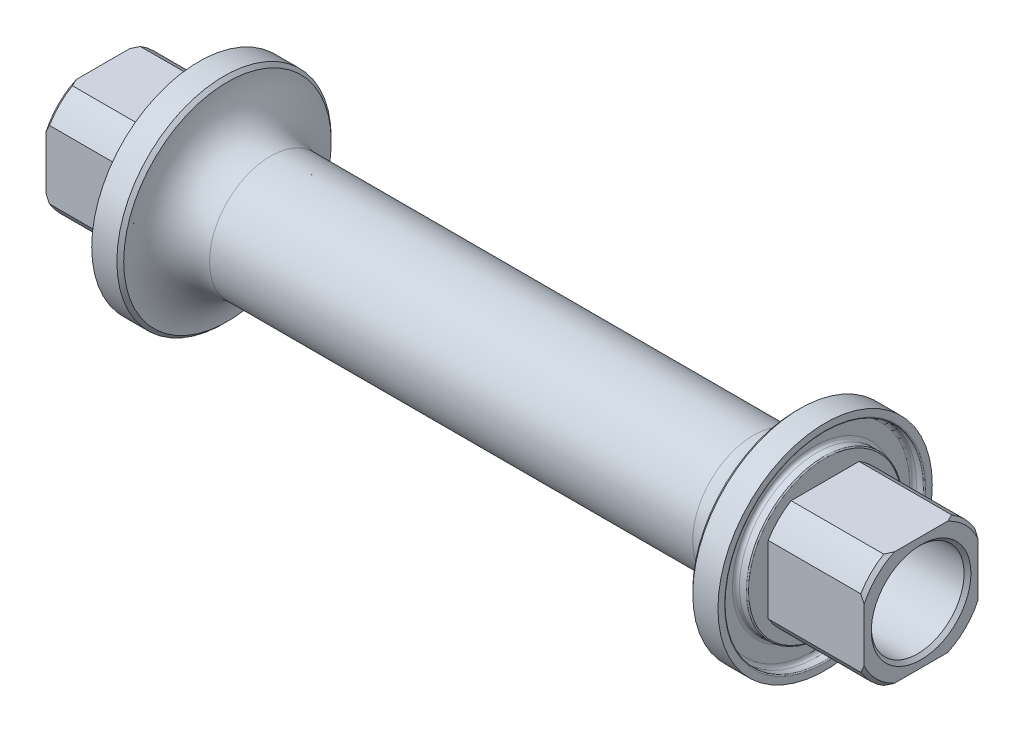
ISO-10303-21;
HEADER;
FILE_DESCRIPTION(('STEP AP214'),'2;1');
FILE_NAME('part.step','',(''),(''),'','','');
FILE_SCHEMA(('AUTOMOTIVE_DESIGN { 1 0 10303 214 1 1 1 1 }'));
ENDSEC;
DATA;
#1=APPLICATION_CONTEXT('core data for automotive mechanical design processes');
#2=APPLICATION_PROTOCOL_DEFINITION('international standard','automotive_design',2000,#1);
#3=PRODUCT_CONTEXT('',#1,'mechanical');
#4=PRODUCT('Part','Part','',(#3));
#5=PRODUCT_RELATED_PRODUCT_CATEGORY('part','',(#4));
#6=PRODUCT_DEFINITION_FORMATION('','',#4);
#7=PRODUCT_DEFINITION_CONTEXT('part definition',#1,'design');
#8=PRODUCT_DEFINITION('design','',#6,#7);
#9=PRODUCT_DEFINITION_SHAPE('','',#8);
#10=(LENGTH_UNIT() NAMED_UNIT(*) SI_UNIT(.MILLI.,.METRE.));
#11=(NAMED_UNIT(*) PLANE_ANGLE_UNIT() SI_UNIT($,.RADIAN.));
#12=(NAMED_UNIT(*) SI_UNIT($,.STERADIAN.) SOLID_ANGLE_UNIT());
#13=UNCERTAINTY_MEASURE_WITH_UNIT(LENGTH_MEASURE(1.E-05),#10,'distance_accuracy_value','');
#14=(GEOMETRIC_REPRESENTATION_CONTEXT(3) GLOBAL_UNCERTAINTY_ASSIGNED_CONTEXT((#13)) GLOBAL_UNIT_ASSIGNED_CONTEXT((#10,
#11,#12)) REPRESENTATION_CONTEXT('',''));
#15=CARTESIAN_POINT('',(0.,0.,0.));
#16=DIRECTION('',(0.,0.,1.));
#17=DIRECTION('',(1.,0.,0.));
#18=AXIS2_PLACEMENT_3D('',#15,#16,#17);
#19=CARTESIAN_POINT('',(69.596,0.,0.));
#20=DIRECTION('',(-1.,0.,0.));
#21=DIRECTION('',(0.,0.,1.));
#22=AXIS2_PLACEMENT_3D('',#19,#20,#21);
#23=PLANE('',#22);
#24=CARTESIAN_POINT('',(69.596,0.,0.));
#25=DIRECTION('',(-1.,0.,0.));
#26=DIRECTION('',(0.,0.,1.));
#27=AXIS2_PLACEMENT_3D('',#24,#25,#26);
#28=CIRCLE('',#27,8.509);
#29=CARTESIAN_POINT('',(69.596,0.,8.509));
#30=VERTEX_POINT('',#29);
#31=EDGE_CURVE('E654',#30,#30,#28,.F.);
#32=ORIENTED_EDGE('',*,*,#31,.T.);
#33=EDGE_LOOP('',(#32));
#34=FACE_BOUND('',#33,.T.);
#35=CARTESIAN_POINT('',(69.596,0.,0.));
#36=DIRECTION('',(1.,0.,0.));
#37=DIRECTION('',(0.,0.,-1.));
#38=AXIS2_PLACEMENT_3D('',#35,#36,#37);
#39=CIRCLE('',#38,7.366);
#40=CARTESIAN_POINT('',(69.596,-6.3246,-3.77589603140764));
#41=VERTEX_POINT('',#40);
#42=CARTESIAN_POINT('',(69.596,-3.77589603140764,-6.3246));
#43=VERTEX_POINT('',#42);
#44=EDGE_CURVE('E196',#41,#43,#39,.T.);
#45=ORIENTED_EDGE('',*,*,#44,.F.);
#46=DIRECTION('',(0.,0.,-1.));
#47=VECTOR('',#46,1.);
#48=CARTESIAN_POINT('',(69.596,-6.3246,-3.77589603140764));
#49=LINE('',#48,#47);
#50=CARTESIAN_POINT('',(69.596,-6.3246,3.77589603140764));
#51=VERTEX_POINT('',#50);
#52=EDGE_CURVE('E209',#51,#41,#49,.T.);
#53=ORIENTED_EDGE('',*,*,#52,.F.);
#54=CARTESIAN_POINT('',(69.596,0.,0.));
#55=DIRECTION('',(1.,0.,0.));
#56=DIRECTION('',(0.,0.,-1.));
#57=AXIS2_PLACEMENT_3D('',#54,#55,#56);
#58=CIRCLE('',#57,7.366);
#59=CARTESIAN_POINT('',(69.596,-3.77589603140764,6.3246));
#60=VERTEX_POINT('',#59);
#61=EDGE_CURVE('E219',#60,#51,#58,.T.);
#62=ORIENTED_EDGE('',*,*,#61,.F.);
#63=DIRECTION('',(0.,-1.,0.));
#64=VECTOR('',#63,1.);
#65=CARTESIAN_POINT('',(69.596,3.77589603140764,6.3246));
#66=LINE('',#65,#64);
#67=CARTESIAN_POINT('',(69.596,3.77589603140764,6.3246));
#68=VERTEX_POINT('',#67);
#69=EDGE_CURVE('E224',#68,#60,#66,.T.);
#70=ORIENTED_EDGE('',*,*,#69,.F.);
#71=CARTESIAN_POINT('',(69.596,0.,0.));
#72=DIRECTION('',(1.,0.,0.));
#73=DIRECTION('',(0.,0.,-1.));
#74=AXIS2_PLACEMENT_3D('',#71,#72,#73);
#75=CIRCLE('',#74,7.366);
#76=CARTESIAN_POINT('',(69.596,6.3246,3.77589603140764));
#77=VERTEX_POINT('',#76);
#78=EDGE_CURVE('E1090',#77,#68,#75,.T.);
#79=ORIENTED_EDGE('',*,*,#78,.F.);
#80=DIRECTION('',(0.,0.,1.));
#81=VECTOR('',#80,1.);
#82=CARTESIAN_POINT('',(69.596,6.3246,-3.77589603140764));
#83=LINE('',#82,#81);
#84=CARTESIAN_POINT('',(69.596,6.3246,-3.77589603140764));
#85=VERTEX_POINT('',#84);
#86=EDGE_CURVE('E1080',#85,#77,#83,.T.);
#87=ORIENTED_EDGE('',*,*,#86,.F.);
#88=CARTESIAN_POINT('',(69.596,0.,0.));
#89=DIRECTION('',(1.,0.,0.));
#90=DIRECTION('',(0.,0.,-1.));
#91=AXIS2_PLACEMENT_3D('',#88,#89,#90);
#92=CIRCLE('',#91,7.366);
#93=CARTESIAN_POINT('',(69.596,3.77589603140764,-6.3246));
#94=VERTEX_POINT('',#93);
#95=EDGE_CURVE('E1094',#94,#85,#92,.T.);
#96=ORIENTED_EDGE('',*,*,#95,.F.);
#97=DIRECTION('',(0.,1.,0.));
#98=VECTOR('',#97,1.);
#99=CARTESIAN_POINT('',(69.596,3.77589603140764,-6.3246));
#100=LINE('',#99,#98);
#101=EDGE_CURVE('E213',#43,#94,#100,.T.);
#102=ORIENTED_EDGE('',*,*,#101,.F.);
#103=EDGE_LOOP('',(#45,#53,#62,#70,#79,#87,#96,#102));
#104=FACE_BOUND('',#103,.T.);
#105=ADVANCED_FACE('F30',(#34,#104),#23,.F.);
#106=CARTESIAN_POINT('',(0.,0.,0.));
#107=DIRECTION('',(1.,0.,0.));
#108=DIRECTION('',(0.,0.,-1.));
#109=AXIS2_PLACEMENT_3D('',#106,#107,#108);
#110=PLANE('',#109);
#111=CARTESIAN_POINT('',(0.,0.,0.));
#112=DIRECTION('',(1.,0.,0.));
#113=DIRECTION('',(0.,0.,-1.));
#114=AXIS2_PLACEMENT_3D('',#111,#112,#113);
#115=CIRCLE('',#114,8.509);
#116=CARTESIAN_POINT('',(0.,0.,-8.509));
#117=VERTEX_POINT('',#116);
#118=EDGE_CURVE('E38',#117,#117,#115,.F.);
#119=ORIENTED_EDGE('',*,*,#118,.T.);
#120=EDGE_LOOP('',(#119));
#121=FACE_BOUND('',#120,.T.);
#122=CARTESIAN_POINT('',(0.,0.,0.));
#123=DIRECTION('',(-1.,0.,0.));
#124=DIRECTION('',(0.,0.,1.));
#125=AXIS2_PLACEMENT_3D('',#122,#123,#124);
#126=CIRCLE('',#125,7.366);
#127=CARTESIAN_POINT('',(0.,3.77589603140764,6.3246));
#128=VERTEX_POINT('',#127);
#129=CARTESIAN_POINT('',(0.,6.3246,3.77589603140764));
#130=VERTEX_POINT('',#129);
#131=EDGE_CURVE('E248',#128,#130,#126,.T.);
#132=ORIENTED_EDGE('',*,*,#131,.F.);
#133=DIRECTION('',(0.,1.,0.));
#134=VECTOR('',#133,1.);
#135=CARTESIAN_POINT('',(0.,3.77589603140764,6.3246));
#136=LINE('',#135,#134);
#137=CARTESIAN_POINT('',(0.,-3.77589603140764,6.3246));
#138=VERTEX_POINT('',#137);
#139=EDGE_CURVE('E269',#138,#128,#136,.T.);
#140=ORIENTED_EDGE('',*,*,#139,.F.);
#141=CARTESIAN_POINT('',(0.,0.,0.));
#142=DIRECTION('',(-1.,0.,0.));
#143=DIRECTION('',(0.,0.,1.));
#144=AXIS2_PLACEMENT_3D('',#141,#142,#143);
#145=CIRCLE('',#144,7.366);
#146=CARTESIAN_POINT('',(0.,-6.3246,3.77589603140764));
#147=VERTEX_POINT('',#146);
#148=EDGE_CURVE('E266',#147,#138,#145,.T.);
#149=ORIENTED_EDGE('',*,*,#148,.F.);
#150=DIRECTION('',(0.,0.,1.));
#151=VECTOR('',#150,1.);
#152=CARTESIAN_POINT('',(0.,-6.3246,3.77589603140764));
#153=LINE('',#152,#151);
#154=CARTESIAN_POINT('',(0.,-6.3246,-3.77589603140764));
#155=VERTEX_POINT('',#154);
#156=EDGE_CURVE('E263',#155,#147,#153,.T.);
#157=ORIENTED_EDGE('',*,*,#156,.F.);
#158=CARTESIAN_POINT('',(0.,0.,0.));
#159=DIRECTION('',(-1.,0.,0.));
#160=DIRECTION('',(0.,0.,1.));
#161=AXIS2_PLACEMENT_3D('',#158,#159,#160);
#162=CIRCLE('',#161,7.366);
#163=CARTESIAN_POINT('',(0.,-3.77589603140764,-6.3246));
#164=VERTEX_POINT('',#163);
#165=EDGE_CURVE('E260',#164,#155,#162,.T.);
#166=ORIENTED_EDGE('',*,*,#165,.F.);
#167=DIRECTION('',(0.,-1.,0.));
#168=VECTOR('',#167,1.);
#169=CARTESIAN_POINT('',(0.,3.77589603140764,-6.3246));
#170=LINE('',#169,#168);
#171=CARTESIAN_POINT('',(0.,3.77589603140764,-6.3246));
#172=VERTEX_POINT('',#171);
#173=EDGE_CURVE('E257',#172,#164,#170,.T.);
#174=ORIENTED_EDGE('',*,*,#173,.F.);
#175=CARTESIAN_POINT('',(0.,0.,0.));
#176=DIRECTION('',(-1.,0.,0.));
#177=DIRECTION('',(0.,0.,1.));
#178=AXIS2_PLACEMENT_3D('',#175,#176,#177);
#179=CIRCLE('',#178,7.366);
#180=CARTESIAN_POINT('',(0.,6.3246,-3.77589603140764));
#181=VERTEX_POINT('',#180);
#182=EDGE_CURVE('E254',#181,#172,#179,.T.);
#183=ORIENTED_EDGE('',*,*,#182,.F.);
#184=DIRECTION('',(0.,0.,-1.));
#185=VECTOR('',#184,1.);
#186=CARTESIAN_POINT('',(0.,6.3246,3.77589603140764));
#187=LINE('',#186,#185);
#188=EDGE_CURVE('E251',#130,#181,#187,.T.);
#189=ORIENTED_EDGE('',*,*,#188,.F.);
#190=EDGE_LOOP('',(#132,#140,#149,#157,#166,#174,#183,#189));
#191=FACE_BOUND('',#190,.T.);
#192=ADVANCED_FACE('F416',(#121,#191),#110,.F.);
#193=CARTESIAN_POINT('',(69.596,0.,0.));
#194=DIRECTION('',(-1.,0.,0.));
#195=DIRECTION('',(0.,0.,1.));
#196=AXIS2_PLACEMENT_3D('',#193,#194,#195);
#197=CIRCLE('',#196,11.176);
#198=CARTESIAN_POINT('',(69.596,0.,11.176));
#199=VERTEX_POINT('',#198);
#200=EDGE_CURVE('E436',#199,#199,#197,.T.);
#201=ORIENTED_EDGE('',*,*,#200,.T.);
#202=EDGE_LOOP('',(#201));
#203=FACE_BOUND('',#202,.T.);
#204=CARTESIAN_POINT('',(69.596,0.,0.));
#205=DIRECTION('',(-1.,0.,0.));
#206=DIRECTION('',(0.,0.,1.));
#207=AXIS2_PLACEMENT_3D('',#204,#205,#206);
#208=CIRCLE('',#207,11.9126);
#209=CARTESIAN_POINT('',(69.596,0.,11.9126));
#210=VERTEX_POINT('',#209);
#211=EDGE_CURVE('E303',#210,#210,#208,.T.);
#212=ORIENTED_EDGE('',*,*,#211,.F.);
#213=EDGE_LOOP('',(#212));
#214=FACE_BOUND('',#213,.T.);
#215=ADVANCED_FACE('F32',(#203,#214),#23,.F.);
#216=CARTESIAN_POINT('',(0.,0.,0.));
#217=DIRECTION('',(-1.,0.,0.));
#218=DIRECTION('',(0.,0.,1.));
#219=AXIS2_PLACEMENT_3D('',#216,#217,#218);
#220=CYLINDRICAL_SURFACE('',#219,11.9126);
#221=CARTESIAN_POINT('',(66.8019843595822,0.,0.));
#222=DIRECTION('',(1.,0.,0.));
#223=DIRECTION('',(0.,0.,-1.));
#224=AXIS2_PLACEMENT_3D('',#221,#222,#223);
#225=CIRCLE('',#224,11.9126);
#226=CARTESIAN_POINT('',(66.8019843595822,0.,-11.9126));
#227=VERTEX_POINT('',#226);
#228=EDGE_CURVE('E321',#227,#227,#225,.T.);
#229=ORIENTED_EDGE('',*,*,#228,.T.);
#230=EDGE_LOOP('',(#229));
#231=FACE_BOUND('',#230,.T.);
#232=ORIENTED_EDGE('',*,*,#211,.T.);
#233=EDGE_LOOP('',(#232));
#234=FACE_BOUND('',#233,.T.);
#235=ADVANCED_FACE('F426',(#231,#234),#220,.T.);
#236=CARTESIAN_POINT('',(0.,0.,0.));
#237=DIRECTION('',(-1.,0.,0.));
#238=DIRECTION('',(0.,0.,1.));
#239=AXIS2_PLACEMENT_3D('',#236,#237,#238);
#240=CYLINDRICAL_SURFACE('',#239,6.7691);
#241=CARTESIAN_POINT('',(61.6458,0.,0.));
#242=DIRECTION('',(1.,0.,0.));
#243=DIRECTION('',(0.,0.,-1.));
#244=AXIS2_PLACEMENT_3D('',#241,#242,#243);
#245=CIRCLE('',#244,6.7691);
#246=CARTESIAN_POINT('',(61.6458,0.,-6.7691));
#247=VERTEX_POINT('',#246);
#248=EDGE_CURVE('E309',#247,#247,#245,.F.);
#249=ORIENTED_EDGE('',*,*,#248,.T.);
#250=EDGE_LOOP('',(#249));
#251=FACE_BOUND('',#250,.T.);
#252=CARTESIAN_POINT('',(7.9502,0.,0.));
#253=DIRECTION('',(-1.,0.,0.));
#254=DIRECTION('',(0.,0.,1.));
#255=AXIS2_PLACEMENT_3D('',#252,#253,#254);
#256=CIRCLE('',#255,6.7691);
#257=CARTESIAN_POINT('',(7.9502,0.,6.7691));
#258=VERTEX_POINT('',#257);
#259=EDGE_CURVE('E306',#258,#258,#256,.F.);
#260=ORIENTED_EDGE('',*,*,#259,.T.);
#261=EDGE_LOOP('',(#260));
#262=FACE_BOUND('',#261,.T.);
#263=ADVANCED_FACE('F431',(#251,#262),#240,.T.);
#264=CARTESIAN_POINT('',(0.,0.,0.));
#265=DIRECTION('',(-1.,0.,0.));
#266=DIRECTION('',(0.,0.,1.));
#267=AXIS2_PLACEMENT_3D('',#264,#265,#266);
#268=CYLINDRICAL_SURFACE('',#267,11.9126);
#269=CARTESIAN_POINT('',(2.7940156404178,0.,0.));
#270=DIRECTION('',(-1.,0.,0.));
#271=DIRECTION('',(0.,0.,1.));
#272=AXIS2_PLACEMENT_3D('',#269,#270,#271);
#273=CIRCLE('',#272,11.9126);
#274=CARTESIAN_POINT('',(2.7940156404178,0.,11.9126));
#275=VERTEX_POINT('',#274);
#276=EDGE_CURVE('E312',#275,#275,#273,.T.);
#277=ORIENTED_EDGE('',*,*,#276,.T.);
#278=EDGE_LOOP('',(#277));
#279=FACE_BOUND('',#278,.T.);
#280=CARTESIAN_POINT('',(0.,0.,0.));
#281=DIRECTION('',(-1.,0.,0.));
#282=DIRECTION('',(0.,0.,1.));
#283=AXIS2_PLACEMENT_3D('',#280,#281,#282);
#284=CIRCLE('',#283,11.9126);
#285=CARTESIAN_POINT('',(0.,0.,11.9126));
#286=VERTEX_POINT('',#285);
#287=EDGE_CURVE('E300',#286,#286,#284,.T.);
#288=ORIENTED_EDGE('',*,*,#287,.F.);
#289=EDGE_LOOP('',(#288));
#290=FACE_BOUND('',#289,.T.);
#291=ADVANCED_FACE('F706',(#279,#290),#268,.T.);
#292=CARTESIAN_POINT('',(0.,0.,0.));
#293=DIRECTION('',(1.,0.,0.));
#294=DIRECTION('',(0.,0.,-1.));
#295=AXIS2_PLACEMENT_3D('',#292,#293,#294);
#296=CIRCLE('',#295,11.176);
#297=CARTESIAN_POINT('',(0.,0.,-11.176));
#298=VERTEX_POINT('',#297);
#299=EDGE_CURVE('E444',#298,#298,#296,.T.);
#300=ORIENTED_EDGE('',*,*,#299,.T.);
#301=EDGE_LOOP('',(#300));
#302=FACE_BOUND('',#301,.T.);
#303=ORIENTED_EDGE('',*,*,#287,.T.);
#304=EDGE_LOOP('',(#303));
#305=FACE_BOUND('',#304,.T.);
#306=ADVANCED_FACE('F423',(#302,#305),#110,.F.);
#307=CARTESIAN_POINT('',(61.6458,0.,0.));
#308=DIRECTION('',(1.,0.,0.));
#309=DIRECTION('',(0.,0.,-1.));
#310=AXIS2_PLACEMENT_3D('',#307,#308,#309);
#311=TOROIDAL_SURFACE('',#310,11.5443,4.7752);
#312=CARTESIAN_POINT('',(66.4209855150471,0.,0.));
#313=DIRECTION('',(-1.,0.,0.));
#314=DIRECTION('',(0.,0.,1.));
#315=AXIS2_PLACEMENT_3D('',#312,#313,#314);
#316=CIRCLE('',#315,11.5325384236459);
#317=CARTESIAN_POINT('',(66.4209855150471,0.,11.5325384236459));
#318=VERTEX_POINT('',#317);
#319=EDGE_CURVE('E318',#318,#318,#316,.T.);
#320=ORIENTED_EDGE('',*,*,#319,.T.);
#321=EDGE_LOOP('',(#320));
#322=FACE_BOUND('',#321,.T.);
#323=ORIENTED_EDGE('',*,*,#248,.F.);
#324=EDGE_LOOP('',(#323));
#325=FACE_BOUND('',#324,.T.);
#326=ADVANCED_FACE('F700',(#322,#325),#311,.F.);
#327=CARTESIAN_POINT('',(7.9502,0.,0.));
#328=DIRECTION('',(-1.,0.,0.));
#329=DIRECTION('',(0.,0.,1.));
#330=AXIS2_PLACEMENT_3D('',#327,#328,#329);
#331=TOROIDAL_SURFACE('',#330,11.5443,4.7752);
#332=CARTESIAN_POINT('',(3.17501448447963,0.,0.));
#333=DIRECTION('',(1.,0.,0.));
#334=DIRECTION('',(0.,0.,-1.));
#335=AXIS2_PLACEMENT_3D('',#332,#333,#334);
#336=CIRCLE('',#335,11.5325384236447);
#337=CARTESIAN_POINT('',(3.17501448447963,0.,-11.5325384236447));
#338=VERTEX_POINT('',#337);
#339=EDGE_CURVE('E315',#338,#338,#336,.T.);
#340=ORIENTED_EDGE('',*,*,#339,.T.);
#341=EDGE_LOOP('',(#340));
#342=FACE_BOUND('',#341,.T.);
#343=ORIENTED_EDGE('',*,*,#259,.F.);
#344=EDGE_LOOP('',(#343));
#345=FACE_BOUND('',#344,.T.);
#346=ADVANCED_FACE('F696',(#342,#345),#331,.F.);
#347=CARTESIAN_POINT('',(2.7940156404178,0.,0.));
#348=DIRECTION('',(-1.,0.,0.));
#349=DIRECTION('',(0.,0.,1.));
#350=AXIS2_PLACEMENT_3D('',#347,#348,#349);
#351=CONICAL_SURFACE('',#350,11.9126,0.784166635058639);
#352=ORIENTED_EDGE('',*,*,#339,.F.);
#353=EDGE_LOOP('',(#352));
#354=FACE_BOUND('',#353,.T.);
#355=ORIENTED_EDGE('',*,*,#276,.F.);
#356=EDGE_LOOP('',(#355));
#357=FACE_BOUND('',#356,.T.);
#358=ADVANCED_FACE('F692',(#354,#357),#351,.T.);
#359=CARTESIAN_POINT('',(66.4209855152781,0.,0.));
#360=DIRECTION('',(1.,0.,0.));
#361=DIRECTION('',(0.,0.,-1.));
#362=AXIS2_PLACEMENT_3D('',#359,#360,#361);
#363=CONICAL_SURFACE('',#362,11.5325384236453,0.784166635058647);
#364=ORIENTED_EDGE('',*,*,#228,.F.);
#365=EDGE_LOOP('',(#364));
#366=FACE_BOUND('',#365,.T.);
#367=ORIENTED_EDGE('',*,*,#319,.F.);
#368=EDGE_LOOP('',(#367));
#369=FACE_BOUND('',#368,.T.);
#370=ADVANCED_FACE('F688',(#366,#369),#363,.T.);
#371=CARTESIAN_POINT('',(1.27,0.,0.));
#372=DIRECTION('',(-1.,0.,0.));
#373=DIRECTION('',(0.,0.,1.));
#374=AXIS2_PLACEMENT_3D('',#371,#372,#373);
#375=CYLINDRICAL_SURFACE('',#374,11.049);
#376=CARTESIAN_POINT('',(0.127,0.,0.));
#377=DIRECTION('',(1.,0.,0.));
#378=DIRECTION('',(0.,0.,-1.));
#379=AXIS2_PLACEMENT_3D('',#376,#377,#378);
#380=CIRCLE('',#379,11.049);
#381=CARTESIAN_POINT('',(0.127,0.,-11.049));
#382=VERTEX_POINT('',#381);
#383=EDGE_CURVE('E440',#382,#382,#380,.F.);
#384=ORIENTED_EDGE('',*,*,#383,.T.);
#385=EDGE_LOOP('',(#384));
#386=FACE_BOUND('',#385,.T.);
#387=CARTESIAN_POINT('',(0.889,0.,0.));
#388=DIRECTION('',(-1.,0.,0.));
#389=DIRECTION('',(0.,0.,1.));
#390=AXIS2_PLACEMENT_3D('',#387,#388,#389);
#391=CIRCLE('',#390,11.049);
#392=CARTESIAN_POINT('',(0.889,0.,11.049));
#393=VERTEX_POINT('',#392);
#394=EDGE_CURVE('E636',#393,#393,#391,.F.);
#395=ORIENTED_EDGE('',*,*,#394,.T.);
#396=EDGE_LOOP('',(#395));
#397=FACE_BOUND('',#396,.T.);
#398=ADVANCED_FACE('F684',(#386,#397),#375,.F.);
#399=CARTESIAN_POINT('',(1.27,0.,0.));
#400=DIRECTION('',(-1.,0.,0.));
#401=DIRECTION('',(0.,0.,1.));
#402=AXIS2_PLACEMENT_3D('',#399,#400,#401);
#403=PLANE('',#402);
#404=CARTESIAN_POINT('',(1.27,0.,0.));
#405=DIRECTION('',(-1.,0.,0.));
#406=DIRECTION('',(0.,0.,1.));
#407=AXIS2_PLACEMENT_3D('',#404,#405,#406);
#408=CIRCLE('',#407,10.668);
#409=CARTESIAN_POINT('',(1.27,0.,10.668));
#410=VERTEX_POINT('',#409);
#411=EDGE_CURVE('E631',#410,#410,#408,.T.);
#412=ORIENTED_EDGE('',*,*,#411,.T.);
#413=EDGE_LOOP('',(#412));
#414=FACE_BOUND('',#413,.T.);
#415=CARTESIAN_POINT('',(1.27,0.,0.));
#416=DIRECTION('',(-1.,0.,0.));
#417=DIRECTION('',(0.,0.,1.));
#418=AXIS2_PLACEMENT_3D('',#415,#416,#417);
#419=CIRCLE('',#418,9.017);
#420=CARTESIAN_POINT('',(1.27,0.,9.017));
#421=VERTEX_POINT('',#420);
#422=EDGE_CURVE('E627',#421,#421,#419,.F.);
#423=ORIENTED_EDGE('',*,*,#422,.T.);
#424=EDGE_LOOP('',(#423));
#425=FACE_BOUND('',#424,.T.);
#426=ADVANCED_FACE('F680',(#414,#425),#403,.T.);
#427=CARTESIAN_POINT('',(1.27,0.,0.));
#428=DIRECTION('',(-1.,0.,0.));
#429=DIRECTION('',(0.,0.,1.));
#430=AXIS2_PLACEMENT_3D('',#427,#428,#429);
#431=CYLINDRICAL_SURFACE('',#430,8.636);
#432=CARTESIAN_POINT('',(0.127,0.,0.));
#433=DIRECTION('',(1.,0.,0.));
#434=DIRECTION('',(0.,0.,-1.));
#435=AXIS2_PLACEMENT_3D('',#432,#433,#434);
#436=CIRCLE('',#435,8.636);
#437=CARTESIAN_POINT('',(0.127,0.,-8.636));
#438=VERTEX_POINT('',#437);
#439=EDGE_CURVE('E11',#438,#438,#436,.T.);
#440=ORIENTED_EDGE('',*,*,#439,.T.);
#441=EDGE_LOOP('',(#440));
#442=FACE_BOUND('',#441,.T.);
#443=CARTESIAN_POINT('',(0.889,0.,0.));
#444=DIRECTION('',(-1.,0.,0.));
#445=DIRECTION('',(0.,0.,1.));
#446=AXIS2_PLACEMENT_3D('',#443,#444,#445);
#447=CIRCLE('',#446,8.636);
#448=CARTESIAN_POINT('',(0.889,0.,8.636));
#449=VERTEX_POINT('',#448);
#450=EDGE_CURVE('E639',#449,#449,#447,.T.);
#451=ORIENTED_EDGE('',*,*,#450,.T.);
#452=EDGE_LOOP('',(#451));
#453=FACE_BOUND('',#452,.T.);
#454=ADVANCED_FACE('F676',(#442,#453),#431,.T.);
#455=CARTESIAN_POINT('',(68.326,0.,0.));
#456=DIRECTION('',(1.,0.,0.));
#457=DIRECTION('',(0.,0.,-1.));
#458=AXIS2_PLACEMENT_3D('',#455,#456,#457);
#459=CYLINDRICAL_SURFACE('',#458,11.049);
#460=CARTESIAN_POINT('',(69.469,0.,0.));
#461=DIRECTION('',(-1.,0.,0.));
#462=DIRECTION('',(0.,0.,1.));
#463=AXIS2_PLACEMENT_3D('',#460,#461,#462);
#464=CIRCLE('',#463,11.049);
#465=CARTESIAN_POINT('',(69.469,0.,11.049));
#466=VERTEX_POINT('',#465);
#467=EDGE_CURVE('E441',#466,#466,#464,.F.);
#468=ORIENTED_EDGE('',*,*,#467,.T.);
#469=EDGE_LOOP('',(#468));
#470=FACE_BOUND('',#469,.T.);
#471=CARTESIAN_POINT('',(68.707,0.,0.));
#472=DIRECTION('',(1.,0.,0.));
#473=DIRECTION('',(0.,0.,-1.));
#474=AXIS2_PLACEMENT_3D('',#471,#472,#473);
#475=CIRCLE('',#474,11.049);
#476=CARTESIAN_POINT('',(68.707,0.,-11.049));
#477=VERTEX_POINT('',#476);
#478=EDGE_CURVE('E648',#477,#477,#475,.F.);
#479=ORIENTED_EDGE('',*,*,#478,.T.);
#480=EDGE_LOOP('',(#479));
#481=FACE_BOUND('',#480,.T.);
#482=ADVANCED_FACE('F670',(#470,#481),#459,.F.);
#483=CARTESIAN_POINT('',(68.326,0.,0.));
#484=DIRECTION('',(1.,0.,0.));
#485=DIRECTION('',(0.,0.,-1.));
#486=AXIS2_PLACEMENT_3D('',#483,#484,#485);
#487=PLANE('',#486);
#488=CARTESIAN_POINT('',(68.326,0.,0.));
#489=DIRECTION('',(1.,0.,0.));
#490=DIRECTION('',(0.,0.,-1.));
#491=AXIS2_PLACEMENT_3D('',#488,#489,#490);
#492=CIRCLE('',#491,10.668);
#493=CARTESIAN_POINT('',(68.326,0.,-10.668));
#494=VERTEX_POINT('',#493);
#495=EDGE_CURVE('E645',#494,#494,#492,.T.);
#496=ORIENTED_EDGE('',*,*,#495,.T.);
#497=EDGE_LOOP('',(#496));
#498=FACE_BOUND('',#497,.T.);
#499=CARTESIAN_POINT('',(68.326,0.,0.));
#500=DIRECTION('',(1.,0.,0.));
#501=DIRECTION('',(0.,0.,-1.));
#502=AXIS2_PLACEMENT_3D('',#499,#500,#501);
#503=CIRCLE('',#502,9.017);
#504=CARTESIAN_POINT('',(68.326,0.,-9.017));
#505=VERTEX_POINT('',#504);
#506=EDGE_CURVE('E642',#505,#505,#503,.F.);
#507=ORIENTED_EDGE('',*,*,#506,.T.);
#508=EDGE_LOOP('',(#507));
#509=FACE_BOUND('',#508,.T.);
#510=ADVANCED_FACE('F663',(#498,#509),#487,.T.);
#511=CARTESIAN_POINT('',(68.326,0.,0.));
#512=DIRECTION('',(1.,0.,0.));
#513=DIRECTION('',(0.,0.,-1.));
#514=AXIS2_PLACEMENT_3D('',#511,#512,#513);
#515=CYLINDRICAL_SURFACE('',#514,8.636);
#516=CARTESIAN_POINT('',(69.469,0.,0.));
#517=DIRECTION('',(-1.,0.,0.));
#518=DIRECTION('',(0.,0.,1.));
#519=AXIS2_PLACEMENT_3D('',#516,#517,#518);
#520=CIRCLE('',#519,8.636);
#521=CARTESIAN_POINT('',(69.469,0.,8.636));
#522=VERTEX_POINT('',#521);
#523=EDGE_CURVE('E447',#522,#522,#520,.T.);
#524=ORIENTED_EDGE('',*,*,#523,.T.);
#525=EDGE_LOOP('',(#524));
#526=FACE_BOUND('',#525,.T.);
#527=CARTESIAN_POINT('',(68.707,0.,0.));
#528=DIRECTION('',(1.,0.,0.));
#529=DIRECTION('',(0.,0.,-1.));
#530=AXIS2_PLACEMENT_3D('',#527,#528,#529);
#531=CIRCLE('',#530,8.636);
#532=CARTESIAN_POINT('',(68.707,0.,-8.636));
#533=VERTEX_POINT('',#532);
#534=EDGE_CURVE('E651',#533,#533,#531,.T.);
#535=ORIENTED_EDGE('',*,*,#534,.T.);
#536=EDGE_LOOP('',(#535));
#537=FACE_BOUND('',#536,.T.);
#538=ADVANCED_FACE('F658',(#526,#537),#515,.T.);
#539=CARTESIAN_POINT('',(-10.668,0.,0.));
#540=DIRECTION('',(1.,0.,0.));
#541=DIRECTION('',(0.,0.,-1.));
#542=AXIS2_PLACEMENT_3D('',#539,#540,#541);
#543=CYLINDRICAL_SURFACE('',#542,7.366);
#544=DIRECTION('',(1.,0.,0.));
#545=VECTOR('',#544,1.);
#546=CARTESIAN_POINT('',(-10.668,6.3246,3.77589603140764));
#547=LINE('',#546,#545);
#548=CARTESIAN_POINT('',(-10.287,6.3246,3.77589603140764));
#549=VERTEX_POINT('',#548);
#550=EDGE_CURVE('E298',#549,#130,#547,.T.);
#551=ORIENTED_EDGE('',*,*,#550,.F.);
#552=CARTESIAN_POINT('',(-10.287,0.,0.));
#553=DIRECTION('',(-1.,0.,0.));
#554=DIRECTION('',(0.,0.,1.));
#555=AXIS2_PLACEMENT_3D('',#552,#553,#554);
#556=CIRCLE('',#555,7.366);
#557=CARTESIAN_POINT('',(-10.287,3.77589603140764,6.3246));
#558=VERTEX_POINT('',#557);
#559=EDGE_CURVE('E53',#549,#558,#556,.F.);
#560=ORIENTED_EDGE('',*,*,#559,.T.);
#561=DIRECTION('',(1.,0.,0.));
#562=VECTOR('',#561,1.);
#563=CARTESIAN_POINT('',(-10.668,3.77589603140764,6.3246));
#564=LINE('',#563,#562);
#565=EDGE_CURVE('E284',#558,#128,#564,.T.);
#566=ORIENTED_EDGE('',*,*,#565,.T.);
#567=ORIENTED_EDGE('',*,*,#131,.T.);
#568=EDGE_LOOP('',(#551,#560,#566,#567));
#569=FACE_BOUND('',#568,.T.);
#570=ADVANCED_FACE('F585',(#569),#543,.T.);
#571=CARTESIAN_POINT('',(-10.668,6.3246,3.77589603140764));
#572=DIRECTION('',(0.,-1.,0.));
#573=DIRECTION('',(0.,0.,-1.));
#574=AXIS2_PLACEMENT_3D('',#571,#572,#573);
#575=PLANE('',#574);
#576=DIRECTION('',(0.,0.,-1.));
#577=VECTOR('',#576,1.);
#578=CARTESIAN_POINT('',(-10.668,6.3246,3.77589603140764));
#579=LINE('',#578,#577);
#580=CARTESIAN_POINT('',(-10.668,6.3246,2.96473604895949));
#581=VERTEX_POINT('',#580);
#582=CARTESIAN_POINT('',(-10.668,6.3246,-2.96473604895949));
#583=VERTEX_POINT('',#582);
#584=EDGE_CURVE('E272',#581,#583,#579,.T.);
#585=ORIENTED_EDGE('',*,*,#584,.F.);
#586=CARTESIAN_POINT('',(-10.668,6.3246,2.96473604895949));
#587=CARTESIAN_POINT('',(-10.6388086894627,6.3246,3.03350973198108));
#588=CARTESIAN_POINT('',(-10.6089138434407,6.3246,3.10198273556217));
#589=CARTESIAN_POINT('',(-10.5478217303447,6.3246,3.23831876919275));
#590=CARTESIAN_POINT('',(-10.5166248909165,6.3246,3.30618199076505));
#591=CARTESIAN_POINT('',(-10.4530151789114,6.3246,3.44133276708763));
#592=CARTESIAN_POINT('',(-10.4206023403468,6.3246,3.50862033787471));
#593=CARTESIAN_POINT('',(-10.3546343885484,6.3246,3.64266070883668));
#594=CARTESIAN_POINT('',(-10.3210789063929,6.3246,3.70941332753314));
#595=CARTESIAN_POINT('',(-10.287,6.3246,3.77589603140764));
#596=B_SPLINE_CURVE_WITH_KNOTS('',3,(#586,#587,#588,#589,#590,#591,#592,#593,#594,#595),
.UNSPECIFIED.,.F.,.F.,(4,2,2,2,4),(0.,0.224130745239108,0.448188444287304,0.672239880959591,
0.896364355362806),.UNSPECIFIED.);
#597=EDGE_CURVE('E589',#581,#549,#596,.T.);
#598=ORIENTED_EDGE('',*,*,#597,.T.);
#599=ORIENTED_EDGE('',*,*,#550,.T.);
#600=ORIENTED_EDGE('',*,*,#188,.T.);
#601=DIRECTION('',(1.,0.,0.));
#602=VECTOR('',#601,1.);
#603=CARTESIAN_POINT('',(-10.668,6.3246,-3.77589603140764));
#604=LINE('',#603,#602);
#605=CARTESIAN_POINT('',(-10.287,6.3246,-3.77589603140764));
#606=VERTEX_POINT('',#605);
#607=EDGE_CURVE('E296',#606,#181,#604,.T.);
#608=ORIENTED_EDGE('',*,*,#607,.F.);
#609=CARTESIAN_POINT('',(-10.287,6.3246,-3.77589603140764));
#610=CARTESIAN_POINT('',(-10.3210789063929,6.3246,-3.70941332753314));
#611=CARTESIAN_POINT('',(-10.3546343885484,6.3246,-3.64266070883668));
#612=CARTESIAN_POINT('',(-10.4206023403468,6.3246,-3.50862033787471));
#613=CARTESIAN_POINT('',(-10.4530151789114,6.3246,-3.44133276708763));
#614=CARTESIAN_POINT('',(-10.5166248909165,6.3246,-3.30618199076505));
#615=CARTESIAN_POINT('',(-10.5478217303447,6.3246,-3.23831876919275));
#616=CARTESIAN_POINT('',(-10.6089138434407,6.3246,-3.10198273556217));
#617=CARTESIAN_POINT('',(-10.6388086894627,6.3246,-3.03350973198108));
#618=CARTESIAN_POINT('',(-10.668,6.3246,-2.96473604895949));
#619=B_SPLINE_CURVE_WITH_KNOTS('',3,(#609,#610,#611,#612,#613,#614,#615,#616,#617,#618),
.UNSPECIFIED.,.F.,.F.,(4,2,2,2,4),(0.,0.224124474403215,0.448175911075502,0.672233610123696,
0.896364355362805),.UNSPECIFIED.);
#620=EDGE_CURVE('E563',#606,#583,#619,.T.);
#621=ORIENTED_EDGE('',*,*,#620,.T.);
#622=EDGE_LOOP('',(#585,#598,#599,#600,#608,#621));
#623=FACE_BOUND('',#622,.T.);
#624=ADVANCED_FACE('F580',(#623),#575,.F.);
#625=CARTESIAN_POINT('',(-10.668,0.,0.));
#626=DIRECTION('',(1.,0.,0.));
#627=DIRECTION('',(0.,0.,-1.));
#628=AXIS2_PLACEMENT_3D('',#625,#626,#627);
#629=CYLINDRICAL_SURFACE('',#628,7.366);
#630=DIRECTION('',(1.,0.,0.));
#631=VECTOR('',#630,1.);
#632=CARTESIAN_POINT('',(-10.668,3.77589603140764,-6.3246));
#633=LINE('',#632,#631);
#634=CARTESIAN_POINT('',(-10.287,3.77589603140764,-6.3246));
#635=VERTEX_POINT('',#634);
#636=EDGE_CURVE('E294',#635,#172,#633,.T.);
#637=ORIENTED_EDGE('',*,*,#636,.F.);
#638=CARTESIAN_POINT('',(-10.287,0.,0.));
#639=DIRECTION('',(-1.,0.,0.));
#640=DIRECTION('',(0.,0.,1.));
#641=AXIS2_PLACEMENT_3D('',#638,#639,#640);
#642=CIRCLE('',#641,7.366);
#643=EDGE_CURVE('E628',#635,#606,#642,.F.);
#644=ORIENTED_EDGE('',*,*,#643,.T.);
#645=ORIENTED_EDGE('',*,*,#607,.T.);
#646=ORIENTED_EDGE('',*,*,#182,.T.);
#647=EDGE_LOOP('',(#637,#644,#645,#646));
#648=FACE_BOUND('',#647,.T.);
#649=ADVANCED_FACE('F576',(#648),#629,.T.);
#650=CARTESIAN_POINT('',(-10.668,3.77589603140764,-6.3246));
#651=DIRECTION('',(0.,0.,1.));
#652=DIRECTION('',(1.,0.,0.));
#653=AXIS2_PLACEMENT_3D('',#650,#651,#652);
#654=PLANE('',#653);
#655=DIRECTION('',(1.,0.,0.));
#656=VECTOR('',#655,1.);
#657=CARTESIAN_POINT('',(-10.668,-3.77589603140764,-6.3246));
#658=LINE('',#657,#656);
#659=CARTESIAN_POINT('',(-10.287,-3.77589603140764,-6.3246));
#660=VERTEX_POINT('',#659);
#661=EDGE_CURVE('E292',#660,#164,#658,.T.);
#662=ORIENTED_EDGE('',*,*,#661,.F.);
#663=CARTESIAN_POINT('',(-10.287,-3.77589603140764,-6.3246));
#664=CARTESIAN_POINT('',(-10.3210789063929,-3.70941332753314,-6.3246));
#665=CARTESIAN_POINT('',(-10.3546343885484,-3.64266070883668,-6.3246));
#666=CARTESIAN_POINT('',(-10.4206023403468,-3.50862033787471,-6.3246));
#667=CARTESIAN_POINT('',(-10.4530151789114,-3.44133276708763,-6.3246));
#668=CARTESIAN_POINT('',(-10.5166248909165,-3.30618199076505,-6.3246));
#669=CARTESIAN_POINT('',(-10.5478217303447,-3.23831876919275,-6.3246));
#670=CARTESIAN_POINT('',(-10.6089138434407,-3.10198273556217,-6.3246));
#671=CARTESIAN_POINT('',(-10.6388086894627,-3.03350973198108,-6.3246));
#672=CARTESIAN_POINT('',(-10.668,-2.96473604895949,-6.3246));
#673=B_SPLINE_CURVE_WITH_KNOTS('',3,(#663,#664,#665,#666,#667,#668,#669,#670,#671,#672),
.UNSPECIFIED.,.F.,.F.,(4,2,2,2,4),(0.,0.224124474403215,0.448175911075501,0.672233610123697,
0.896364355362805),.UNSPECIFIED.);
#674=CARTESIAN_POINT('',(-10.668,-2.96473604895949,-6.3246));
#675=VERTEX_POINT('',#674);
#676=EDGE_CURVE('E558',#660,#675,#673,.T.);
#677=ORIENTED_EDGE('',*,*,#676,.T.);
#678=DIRECTION('',(0.,-1.,0.));
#679=VECTOR('',#678,1.);
#680=CARTESIAN_POINT('',(-10.668,3.77589603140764,-6.3246));
#681=LINE('',#680,#679);
#682=CARTESIAN_POINT('',(-10.668,2.96473604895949,-6.3246));
#683=VERTEX_POINT('',#682);
#684=EDGE_CURVE('E275',#683,#675,#681,.T.);
#685=ORIENTED_EDGE('',*,*,#684,.F.);
#686=CARTESIAN_POINT('',(-10.668,2.96473604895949,-6.3246));
#687=CARTESIAN_POINT('',(-10.6388086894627,3.03350973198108,-6.3246));
#688=CARTESIAN_POINT('',(-10.6089138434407,3.10198273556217,-6.3246));
#689=CARTESIAN_POINT('',(-10.5478217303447,3.23831876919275,-6.3246));
#690=CARTESIAN_POINT('',(-10.5166248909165,3.30618199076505,-6.3246));
#691=CARTESIAN_POINT('',(-10.4530151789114,3.44133276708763,-6.3246));
#692=CARTESIAN_POINT('',(-10.4206023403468,3.50862033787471,-6.3246));
#693=CARTESIAN_POINT('',(-10.3546343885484,3.64266070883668,-6.3246));
#694=CARTESIAN_POINT('',(-10.3210789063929,3.70941332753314,-6.3246));
#695=CARTESIAN_POINT('',(-10.287,3.77589603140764,-6.3246));
#696=B_SPLINE_CURVE_WITH_KNOTS('',3,(#686,#687,#688,#689,#690,#691,#692,#693,#694,#695),
.UNSPECIFIED.,.F.,.F.,(4,2,2,2,4),(0.,0.224130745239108,0.448188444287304,0.672239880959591,
0.896364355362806),.UNSPECIFIED.);
#697=EDGE_CURVE('E564',#683,#635,#696,.T.);
#698=ORIENTED_EDGE('',*,*,#697,.T.);
#699=ORIENTED_EDGE('',*,*,#636,.T.);
#700=ORIENTED_EDGE('',*,*,#173,.T.);
#701=EDGE_LOOP('',(#662,#677,#685,#698,#699,#700));
#702=FACE_BOUND('',#701,.T.);
#703=ADVANCED_FACE('F572',(#702),#654,.F.);
#704=CARTESIAN_POINT('',(-10.668,0.,0.));
#705=DIRECTION('',(1.,0.,0.));
#706=DIRECTION('',(0.,0.,-1.));
#707=AXIS2_PLACEMENT_3D('',#704,#705,#706);
#708=CYLINDRICAL_SURFACE('',#707,7.366);
#709=DIRECTION('',(1.,0.,0.));
#710=VECTOR('',#709,1.);
#711=CARTESIAN_POINT('',(-10.668,-6.3246,-3.77589603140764));
#712=LINE('',#711,#710);
#713=CARTESIAN_POINT('',(-10.287,-6.3246,-3.77589603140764));
#714=VERTEX_POINT('',#713);
#715=EDGE_CURVE('E290',#714,#155,#712,.T.);
#716=ORIENTED_EDGE('',*,*,#715,.F.);
#717=CARTESIAN_POINT('',(-10.287,0.,0.));
#718=DIRECTION('',(-1.,0.,0.));
#719=DIRECTION('',(0.,0.,1.));
#720=AXIS2_PLACEMENT_3D('',#717,#718,#719);
#721=CIRCLE('',#720,7.366);
#722=EDGE_CURVE('E546',#714,#660,#721,.F.);
#723=ORIENTED_EDGE('',*,*,#722,.T.);
#724=ORIENTED_EDGE('',*,*,#661,.T.);
#725=ORIENTED_EDGE('',*,*,#165,.T.);
#726=EDGE_LOOP('',(#716,#723,#724,#725));
#727=FACE_BOUND('',#726,.T.);
#728=ADVANCED_FACE('F536',(#727),#708,.T.);
#729=CARTESIAN_POINT('',(-10.668,-6.3246,3.77589603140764));
#730=DIRECTION('',(0.,1.,0.));
#731=DIRECTION('',(0.,0.,1.));
#732=AXIS2_PLACEMENT_3D('',#729,#730,#731);
#733=PLANE('',#732);
#734=DIRECTION('',(0.,0.,1.));
#735=VECTOR('',#734,1.);
#736=CARTESIAN_POINT('',(-10.668,-6.3246,3.77589603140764));
#737=LINE('',#736,#735);
#738=CARTESIAN_POINT('',(-10.668,-6.3246,-2.96473604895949));
#739=VERTEX_POINT('',#738);
#740=CARTESIAN_POINT('',(-10.668,-6.3246,2.96473604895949));
#741=VERTEX_POINT('',#740);
#742=EDGE_CURVE('E278',#739,#741,#737,.T.);
#743=ORIENTED_EDGE('',*,*,#742,.F.);
#744=CARTESIAN_POINT('',(-10.668,-6.3246,-2.96473604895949));
#745=CARTESIAN_POINT('',(-10.6388086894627,-6.3246,-3.03350973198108));
#746=CARTESIAN_POINT('',(-10.6089138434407,-6.3246,-3.10198273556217));
#747=CARTESIAN_POINT('',(-10.5478217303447,-6.3246,-3.23831876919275));
#748=CARTESIAN_POINT('',(-10.5166248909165,-6.3246,-3.30618199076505));
#749=CARTESIAN_POINT('',(-10.4530151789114,-6.3246,-3.44133276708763));
#750=CARTESIAN_POINT('',(-10.4206023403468,-6.3246,-3.50862033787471));
#751=CARTESIAN_POINT('',(-10.3546343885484,-6.3246,-3.64266070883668));
#752=CARTESIAN_POINT('',(-10.3210789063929,-6.3246,-3.70941332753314));
#753=CARTESIAN_POINT('',(-10.287,-6.3246,-3.77589603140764));
#754=B_SPLINE_CURVE_WITH_KNOTS('',3,(#744,#745,#746,#747,#748,#749,#750,#751,#752,#753),
.UNSPECIFIED.,.F.,.F.,(4,2,2,2,4),(0.,0.224130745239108,0.448188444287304,0.672239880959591,
0.896364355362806),.UNSPECIFIED.);
#755=EDGE_CURVE('E540',#739,#714,#754,.T.);
#756=ORIENTED_EDGE('',*,*,#755,.T.);
#757=ORIENTED_EDGE('',*,*,#715,.T.);
#758=ORIENTED_EDGE('',*,*,#156,.T.);
#759=DIRECTION('',(1.,0.,0.));
#760=VECTOR('',#759,1.);
#761=CARTESIAN_POINT('',(-10.668,-6.3246,3.77589603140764));
#762=LINE('',#761,#760);
#763=CARTESIAN_POINT('',(-10.287,-6.3246,3.77589603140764));
#764=VERTEX_POINT('',#763);
#765=EDGE_CURVE('E288',#764,#147,#762,.T.);
#766=ORIENTED_EDGE('',*,*,#765,.F.);
#767=CARTESIAN_POINT('',(-10.287,-6.3246,3.77589603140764));
#768=CARTESIAN_POINT('',(-10.3210789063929,-6.3246,3.70941332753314));
#769=CARTESIAN_POINT('',(-10.3546343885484,-6.3246,3.64266070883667));
#770=CARTESIAN_POINT('',(-10.4206023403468,-6.3246,3.50862033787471));
#771=CARTESIAN_POINT('',(-10.4530151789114,-6.3246,3.44133276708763));
#772=CARTESIAN_POINT('',(-10.5166248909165,-6.3246,3.30618199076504));
#773=CARTESIAN_POINT('',(-10.5478217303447,-6.3246,3.23831876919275));
#774=CARTESIAN_POINT('',(-10.6089138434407,-6.3246,3.10198273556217));
#775=CARTESIAN_POINT('',(-10.6388086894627,-6.3246,3.03350973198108));
#776=CARTESIAN_POINT('',(-10.668,-6.3246,2.96473604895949));
#777=B_SPLINE_CURVE_WITH_KNOTS('',3,(#767,#768,#769,#770,#771,#772,#773,#774,#775,#776),
.UNSPECIFIED.,.F.,.F.,(4,2,2,2,4),(0.,0.224124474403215,0.448175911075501,0.672233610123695,
0.896364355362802),.UNSPECIFIED.);
#778=EDGE_CURVE('E501',#764,#741,#777,.T.);
#779=ORIENTED_EDGE('',*,*,#778,.T.);
#780=EDGE_LOOP('',(#743,#756,#757,#758,#766,#779));
#781=FACE_BOUND('',#780,.T.);
#782=ADVANCED_FACE('F531',(#781),#733,.F.);
#783=CARTESIAN_POINT('',(-10.668,0.,0.));
#784=DIRECTION('',(1.,0.,0.));
#785=DIRECTION('',(0.,0.,-1.));
#786=AXIS2_PLACEMENT_3D('',#783,#784,#785);
#787=CYLINDRICAL_SURFACE('',#786,7.366);
#788=DIRECTION('',(1.,0.,0.));
#789=VECTOR('',#788,1.);
#790=CARTESIAN_POINT('',(-10.668,-3.77589603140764,6.3246));
#791=LINE('',#790,#789);
#792=CARTESIAN_POINT('',(-10.287,-3.77589603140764,6.3246));
#793=VERTEX_POINT('',#792);
#794=EDGE_CURVE('E286',#793,#138,#791,.T.);
#795=ORIENTED_EDGE('',*,*,#794,.F.);
#796=CARTESIAN_POINT('',(-10.287,0.,0.));
#797=DIRECTION('',(-1.,0.,0.));
#798=DIRECTION('',(0.,0.,1.));
#799=AXIS2_PLACEMENT_3D('',#796,#797,#798);
#800=CIRCLE('',#799,7.366);
#801=EDGE_CURVE('E626',#793,#764,#800,.F.);
#802=ORIENTED_EDGE('',*,*,#801,.T.);
#803=ORIENTED_EDGE('',*,*,#765,.T.);
#804=ORIENTED_EDGE('',*,*,#148,.T.);
#805=EDGE_LOOP('',(#795,#802,#803,#804));
#806=FACE_BOUND('',#805,.T.);
#807=ADVANCED_FACE('F527',(#806),#787,.T.);
#808=CARTESIAN_POINT('',(-10.668,3.77589603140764,6.3246));
#809=DIRECTION('',(0.,0.,-1.));
#810=DIRECTION('',(-1.,0.,0.));
#811=AXIS2_PLACEMENT_3D('',#808,#809,#810);
#812=PLANE('',#811);
#813=ORIENTED_EDGE('',*,*,#565,.F.);
#814=CARTESIAN_POINT('',(-10.287,3.77589603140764,6.3246));
#815=CARTESIAN_POINT('',(-10.3210789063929,3.70941332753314,6.3246));
#816=CARTESIAN_POINT('',(-10.3546343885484,3.64266070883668,6.3246));
#817=CARTESIAN_POINT('',(-10.4206023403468,3.50862033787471,6.3246));
#818=CARTESIAN_POINT('',(-10.4530151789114,3.44133276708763,6.3246));
#819=CARTESIAN_POINT('',(-10.5166248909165,3.30618199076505,6.3246));
#820=CARTESIAN_POINT('',(-10.5478217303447,3.23831876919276,6.3246));
#821=CARTESIAN_POINT('',(-10.6089138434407,3.10198273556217,6.3246));
#822=CARTESIAN_POINT('',(-10.6388086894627,3.03350973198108,6.3246));
#823=CARTESIAN_POINT('',(-10.668,2.96473604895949,6.3246));
#824=B_SPLINE_CURVE_WITH_KNOTS('',3,(#814,#815,#816,#817,#818,#819,#820,#821,#822,#823),
.UNSPECIFIED.,.F.,.F.,(4,2,2,2,4),(0.,0.224124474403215,0.448175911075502,0.672233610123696,
0.896364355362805),.UNSPECIFIED.);
#825=CARTESIAN_POINT('',(-10.668,2.96473604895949,6.3246));
#826=VERTEX_POINT('',#825);
#827=EDGE_CURVE('E515',#558,#826,#824,.T.);
#828=ORIENTED_EDGE('',*,*,#827,.T.);
#829=DIRECTION('',(0.,1.,0.));
#830=VECTOR('',#829,1.);
#831=CARTESIAN_POINT('',(-10.668,3.77589603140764,6.3246));
#832=LINE('',#831,#830);
#833=CARTESIAN_POINT('',(-10.668,-2.96473604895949,6.3246));
#834=VERTEX_POINT('',#833);
#835=EDGE_CURVE('E281',#834,#826,#832,.T.);
#836=ORIENTED_EDGE('',*,*,#835,.F.);
#837=CARTESIAN_POINT('',(-10.668,-2.96473604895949,6.3246));
#838=CARTESIAN_POINT('',(-10.6388086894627,-3.03350973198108,6.3246));
#839=CARTESIAN_POINT('',(-10.6089138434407,-3.10198273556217,6.3246));
#840=CARTESIAN_POINT('',(-10.5478217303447,-3.23831876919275,6.3246));
#841=CARTESIAN_POINT('',(-10.5166248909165,-3.30618199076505,6.3246));
#842=CARTESIAN_POINT('',(-10.4530151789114,-3.44133276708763,6.3246));
#843=CARTESIAN_POINT('',(-10.4206023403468,-3.50862033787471,6.3246));
#844=CARTESIAN_POINT('',(-10.3546343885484,-3.64266070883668,6.3246));
#845=CARTESIAN_POINT('',(-10.3210789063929,-3.70941332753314,6.3246));
#846=CARTESIAN_POINT('',(-10.287,-3.77589603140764,6.3246));
#847=B_SPLINE_CURVE_WITH_KNOTS('',3,(#837,#838,#839,#840,#841,#842,#843,#844,#845,#846),
.UNSPECIFIED.,.F.,.F.,(4,2,2,2,4),(0.,0.224130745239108,0.448188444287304,0.672239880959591,
0.896364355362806),.UNSPECIFIED.);
#848=EDGE_CURVE('E45',#834,#793,#847,.T.);
#849=ORIENTED_EDGE('',*,*,#848,.T.);
#850=ORIENTED_EDGE('',*,*,#794,.T.);
#851=ORIENTED_EDGE('',*,*,#139,.T.);
#852=EDGE_LOOP('',(#813,#828,#836,#849,#850,#851));
#853=FACE_BOUND('',#852,.T.);
#854=ADVANCED_FACE('F521',(#853),#812,.F.);
#855=CARTESIAN_POINT('',(-10.668,0.,0.));
#856=DIRECTION('',(-1.,0.,0.));
#857=DIRECTION('',(0.,0.,1.));
#858=AXIS2_PLACEMENT_3D('',#855,#856,#857);
#859=PLANE('',#858);
#860=CARTESIAN_POINT('',(-10.668,0.,0.));
#861=DIRECTION('',(-1.,0.,0.));
#862=DIRECTION('',(0.,0.,1.));
#863=AXIS2_PLACEMENT_3D('',#860,#861,#862);
#864=CIRCLE('',#863,5.53720000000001);
#865=CARTESIAN_POINT('',(-10.668,0.,5.53720000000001));
#866=VERTEX_POINT('',#865);
#867=EDGE_CURVE('E616',#866,#866,#864,.F.);
#868=ORIENTED_EDGE('',*,*,#867,.T.);
#869=EDGE_LOOP('',(#868));
#870=FACE_BOUND('',#869,.T.);
#871=ORIENTED_EDGE('',*,*,#684,.T.);
#872=CARTESIAN_POINT('',(-10.668,0.,0.));
#873=DIRECTION('',(-1.,0.,0.));
#874=DIRECTION('',(0.,0.,1.));
#875=AXIS2_PLACEMENT_3D('',#872,#873,#874);
#876=CIRCLE('',#875,6.98499999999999);
#877=EDGE_CURVE('E608',#675,#739,#876,.T.);
#878=ORIENTED_EDGE('',*,*,#877,.T.);
#879=ORIENTED_EDGE('',*,*,#742,.T.);
#880=CARTESIAN_POINT('',(-10.668,0.,0.));
#881=DIRECTION('',(-1.,0.,0.));
#882=DIRECTION('',(0.,0.,1.));
#883=AXIS2_PLACEMENT_3D('',#880,#881,#882);
#884=CIRCLE('',#883,6.98499999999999);
#885=EDGE_CURVE('E606',#741,#834,#884,.T.);
#886=ORIENTED_EDGE('',*,*,#885,.T.);
#887=ORIENTED_EDGE('',*,*,#835,.T.);
#888=CARTESIAN_POINT('',(-10.668,0.,0.));
#889=DIRECTION('',(-1.,0.,0.));
#890=DIRECTION('',(0.,0.,1.));
#891=AXIS2_PLACEMENT_3D('',#888,#889,#890);
#892=CIRCLE('',#891,6.98499999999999);
#893=EDGE_CURVE('E605',#826,#581,#892,.T.);
#894=ORIENTED_EDGE('',*,*,#893,.T.);
#895=ORIENTED_EDGE('',*,*,#584,.T.);
#896=CARTESIAN_POINT('',(-10.668,0.,0.));
#897=DIRECTION('',(-1.,0.,0.));
#898=DIRECTION('',(0.,0.,1.));
#899=AXIS2_PLACEMENT_3D('',#896,#897,#898);
#900=CIRCLE('',#899,6.98499999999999);
#901=EDGE_CURVE('E602',#583,#683,#900,.T.);
#902=ORIENTED_EDGE('',*,*,#901,.T.);
#903=EDGE_LOOP('',(#871,#878,#879,#886,#887,#894,#895,#902));
#904=FACE_BOUND('',#903,.T.);
#905=ADVANCED_FACE('F526',(#870,#904),#859,.T.);
#906=CARTESIAN_POINT('',(80.264,0.,0.));
#907=DIRECTION('',(-1.,0.,0.));
#908=DIRECTION('',(0.,0.,1.));
#909=AXIS2_PLACEMENT_3D('',#906,#907,#908);
#910=CYLINDRICAL_SURFACE('',#909,7.366);
#911=DIRECTION('',(-1.,0.,0.));
#912=VECTOR('',#911,1.);
#913=CARTESIAN_POINT('',(80.264,-3.77589603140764,-6.3246));
#914=LINE('',#913,#912);
#915=CARTESIAN_POINT('',(79.883,-3.77589603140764,-6.3246));
#916=VERTEX_POINT('',#915);
#917=EDGE_CURVE('E246',#916,#43,#914,.T.);
#918=ORIENTED_EDGE('',*,*,#917,.F.);
#919=CARTESIAN_POINT('',(79.883,0.,0.));
#920=DIRECTION('',(1.,0.,0.));
#921=DIRECTION('',(0.,0.,-1.));
#922=AXIS2_PLACEMENT_3D('',#919,#920,#921);
#923=CIRCLE('',#922,7.366);
#924=CARTESIAN_POINT('',(79.883,-6.3246,-3.77589603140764));
#925=VERTEX_POINT('',#924);
#926=EDGE_CURVE('E198',#916,#925,#923,.F.);
#927=ORIENTED_EDGE('',*,*,#926,.T.);
#928=DIRECTION('',(-1.,0.,0.));
#929=VECTOR('',#928,1.);
#930=CARTESIAN_POINT('',(80.264,-6.3246,-3.77589603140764));
#931=LINE('',#930,#929);
#932=EDGE_CURVE('E192',#925,#41,#931,.T.);
#933=ORIENTED_EDGE('',*,*,#932,.T.);
#934=ORIENTED_EDGE('',*,*,#44,.T.);
#935=EDGE_LOOP('',(#918,#927,#933,#934));
#936=FACE_BOUND('',#935,.T.);
#937=ADVANCED_FACE('F195',(#936),#910,.T.);
#938=CARTESIAN_POINT('',(80.264,3.77589603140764,-6.3246));
#939=DIRECTION('',(0.,0.,1.));
#940=DIRECTION('',(1.,0.,0.));
#941=AXIS2_PLACEMENT_3D('',#938,#939,#940);
#942=PLANE('',#941);
#943=DIRECTION('',(0.,1.,0.));
#944=VECTOR('',#943,1.);
#945=CARTESIAN_POINT('',(80.264,3.77589603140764,-6.3246));
#946=LINE('',#945,#944);
#947=CARTESIAN_POINT('',(80.264,-2.96473604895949,-6.3246));
#948=VERTEX_POINT('',#947);
#949=CARTESIAN_POINT('',(80.264,2.96473604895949,-6.3246));
#950=VERTEX_POINT('',#949);
#951=EDGE_CURVE('E218',#948,#950,#946,.T.);
#952=ORIENTED_EDGE('',*,*,#951,.F.);
#953=CARTESIAN_POINT('',(80.264,-2.96473604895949,-6.3246));
#954=CARTESIAN_POINT('',(80.2348086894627,-3.03350973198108,-6.3246));
#955=CARTESIAN_POINT('',(80.2049138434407,-3.10198273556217,-6.3246));
#956=CARTESIAN_POINT('',(80.1438217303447,-3.23831876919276,-6.3246));
#957=CARTESIAN_POINT('',(80.1126248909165,-3.30618199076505,-6.3246));
#958=CARTESIAN_POINT('',(80.0490151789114,-3.44133276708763,-6.3246));
#959=CARTESIAN_POINT('',(80.0166023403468,-3.50862033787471,-6.3246));
#960=CARTESIAN_POINT('',(79.9506343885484,-3.64266070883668,-6.3246));
#961=CARTESIAN_POINT('',(79.9170789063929,-3.70941332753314,-6.3246));
#962=CARTESIAN_POINT('',(79.883,-3.77589603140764,-6.3246));
#963=B_SPLINE_CURVE_WITH_KNOTS('',3,(#953,#954,#955,#956,#957,#958,#959,#960,#961,#962),
.UNSPECIFIED.,.F.,.F.,(4,2,2,2,4),(0.,0.224130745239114,0.448188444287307,0.672239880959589,
0.896364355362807),.UNSPECIFIED.);
#964=EDGE_CURVE('E1059',#948,#916,#963,.T.);
#965=ORIENTED_EDGE('',*,*,#964,.T.);
#966=ORIENTED_EDGE('',*,*,#917,.T.);
#967=ORIENTED_EDGE('',*,*,#101,.T.);
#968=DIRECTION('',(-1.,0.,0.));
#969=VECTOR('',#968,1.);
#970=CARTESIAN_POINT('',(80.264,3.77589603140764,-6.3246));
#971=LINE('',#970,#969);
#972=CARTESIAN_POINT('',(79.883,3.77589603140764,-6.3246));
#973=VERTEX_POINT('',#972);
#974=EDGE_CURVE('E244',#973,#94,#971,.T.);
#975=ORIENTED_EDGE('',*,*,#974,.F.);
#976=CARTESIAN_POINT('',(79.883,3.77589603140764,-6.3246));
#977=CARTESIAN_POINT('',(79.9170789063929,3.70941332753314,-6.3246));
#978=CARTESIAN_POINT('',(79.9506343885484,3.64266070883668,-6.3246));
#979=CARTESIAN_POINT('',(80.0166023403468,3.50862033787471,-6.3246));
#980=CARTESIAN_POINT('',(80.0490151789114,3.44133276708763,-6.3246));
#981=CARTESIAN_POINT('',(80.1126248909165,3.30618199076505,-6.3246));
#982=CARTESIAN_POINT('',(80.1438217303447,3.23831876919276,-6.3246));
#983=CARTESIAN_POINT('',(80.2049138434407,3.10198273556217,-6.3246));
#984=CARTESIAN_POINT('',(80.2348086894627,3.03350973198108,-6.3246));
#985=CARTESIAN_POINT('',(80.264,2.96473604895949,-6.3246));
#986=B_SPLINE_CURVE_WITH_KNOTS('',3,(#976,#977,#978,#979,#980,#981,#982,#983,#984,#985),
.UNSPECIFIED.,.F.,.F.,(4,2,2,2,4),(0.,0.224124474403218,0.4481759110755,0.672233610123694,
0.896364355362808),.UNSPECIFIED.);
#987=EDGE_CURVE('E392',#973,#950,#986,.T.);
#988=ORIENTED_EDGE('',*,*,#987,.T.);
#989=EDGE_LOOP('',(#952,#965,#966,#967,#975,#988));
#990=FACE_BOUND('',#989,.T.);
#991=ADVANCED_FACE('F838',(#990),#942,.F.);
#992=CARTESIAN_POINT('',(80.264,0.,0.));
#993=DIRECTION('',(-1.,0.,0.));
#994=DIRECTION('',(0.,0.,1.));
#995=AXIS2_PLACEMENT_3D('',#992,#993,#994);
#996=CYLINDRICAL_SURFACE('',#995,7.366);
#997=DIRECTION('',(-1.,0.,0.));
#998=VECTOR('',#997,1.);
#999=CARTESIAN_POINT('',(80.264,6.3246,-3.77589603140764));
#1000=LINE('',#999,#998);
#1001=CARTESIAN_POINT('',(79.883,6.3246,-3.77589603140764));
#1002=VERTEX_POINT('',#1001);
#1003=EDGE_CURVE('E242',#1002,#85,#1000,.T.);
#1004=ORIENTED_EDGE('',*,*,#1003,.F.);
#1005=CARTESIAN_POINT('',(79.883,0.,0.));
#1006=DIRECTION('',(1.,0.,0.));
#1007=DIRECTION('',(0.,0.,-1.));
#1008=AXIS2_PLACEMENT_3D('',#1005,#1006,#1007);
#1009=CIRCLE('',#1008,7.366);
#1010=EDGE_CURVE('E1071',#1002,#973,#1009,.F.);
#1011=ORIENTED_EDGE('',*,*,#1010,.T.);
#1012=ORIENTED_EDGE('',*,*,#974,.T.);
#1013=ORIENTED_EDGE('',*,*,#95,.T.);
#1014=EDGE_LOOP('',(#1004,#1011,#1012,#1013));
#1015=FACE_BOUND('',#1014,.T.);
#1016=ADVANCED_FACE('F846',(#1015),#996,.T.);
#1017=CARTESIAN_POINT('',(80.264,6.3246,-3.77589603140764));
#1018=DIRECTION('',(0.,-1.,0.));
#1019=DIRECTION('',(0.,0.,-1.));
#1020=AXIS2_PLACEMENT_3D('',#1017,#1018,#1019);
#1021=PLANE('',#1020);
#1022=DIRECTION('',(0.,0.,1.));
#1023=VECTOR('',#1022,1.);
#1024=CARTESIAN_POINT('',(80.264,6.3246,-3.77589603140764));
#1025=LINE('',#1024,#1023);
#1026=CARTESIAN_POINT('',(80.264,6.3246,-2.96473604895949));
#1027=VERTEX_POINT('',#1026);
#1028=CARTESIAN_POINT('',(80.264,6.3246,2.96473604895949));
#1029=VERTEX_POINT('',#1028);
#1030=EDGE_CURVE('E222',#1027,#1029,#1025,.T.);
#1031=ORIENTED_EDGE('',*,*,#1030,.F.);
#1032=CARTESIAN_POINT('',(80.264,6.3246,-2.96473604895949));
#1033=CARTESIAN_POINT('',(80.2348086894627,6.3246,-3.03350973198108));
#1034=CARTESIAN_POINT('',(80.2049138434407,6.3246,-3.10198273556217));
#1035=CARTESIAN_POINT('',(80.1438217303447,6.3246,-3.23831876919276));
#1036=CARTESIAN_POINT('',(80.1126248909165,6.3246,-3.30618199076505));
#1037=CARTESIAN_POINT('',(80.0490151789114,6.3246,-3.44133276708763));
#1038=CARTESIAN_POINT('',(80.0166023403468,6.3246,-3.50862033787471));
#1039=CARTESIAN_POINT('',(79.9506343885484,6.3246,-3.64266070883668));
#1040=CARTESIAN_POINT('',(79.9170789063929,6.3246,-3.70941332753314));
#1041=CARTESIAN_POINT('',(79.883,6.3246,-3.77589603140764));
#1042=B_SPLINE_CURVE_WITH_KNOTS('',3,(#1032,#1033,#1034,#1035,#1036,#1037,#1038,#1039,#1040,
#1041),.UNSPECIFIED.,.F.,.F.,(4,2,2,2,4),(0.,0.224130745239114,0.448188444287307,
0.672239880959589,0.896364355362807),.UNSPECIFIED.);
#1043=EDGE_CURVE('E1050',#1027,#1002,#1042,.T.);
#1044=ORIENTED_EDGE('',*,*,#1043,.T.);
#1045=ORIENTED_EDGE('',*,*,#1003,.T.);
#1046=ORIENTED_EDGE('',*,*,#86,.T.);
#1047=DIRECTION('',(-1.,0.,0.));
#1048=VECTOR('',#1047,1.);
#1049=CARTESIAN_POINT('',(80.264,6.3246,3.77589603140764));
#1050=LINE('',#1049,#1048);
#1051=CARTESIAN_POINT('',(79.883,6.3246,3.77589603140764));
#1052=VERTEX_POINT('',#1051);
#1053=EDGE_CURVE('E240',#1052,#77,#1050,.T.);
#1054=ORIENTED_EDGE('',*,*,#1053,.F.);
#1055=CARTESIAN_POINT('',(79.883,6.3246,3.77589603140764));
#1056=CARTESIAN_POINT('',(79.9170789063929,6.3246,3.70941332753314));
#1057=CARTESIAN_POINT('',(79.9506343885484,6.3246,3.64266070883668));
#1058=CARTESIAN_POINT('',(80.0166023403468,6.3246,3.50862033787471));
#1059=CARTESIAN_POINT('',(80.0490151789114,6.3246,3.44133276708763));
#1060=CARTESIAN_POINT('',(80.1126248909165,6.3246,3.30618199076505));
#1061=CARTESIAN_POINT('',(80.1438217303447,6.3246,3.23831876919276));
#1062=CARTESIAN_POINT('',(80.2049138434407,6.3246,3.10198273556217));
#1063=CARTESIAN_POINT('',(80.2348086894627,6.3246,3.03350973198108));
#1064=CARTESIAN_POINT('',(80.264,6.3246,2.96473604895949));
#1065=B_SPLINE_CURVE_WITH_KNOTS('',3,(#1055,#1056,#1057,#1058,#1059,#1060,#1061,#1062,#1063,
#1064),.UNSPECIFIED.,.F.,.F.,(4,2,2,2,4),(0.,0.224124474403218,0.4481759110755,
0.672233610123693,0.896364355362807),.UNSPECIFIED.);
#1066=EDGE_CURVE('E1044',#1052,#1029,#1065,.T.);
#1067=ORIENTED_EDGE('',*,*,#1066,.T.);
#1068=EDGE_LOOP('',(#1031,#1044,#1045,#1046,#1054,#1067));
#1069=FACE_BOUND('',#1068,.T.);
#1070=ADVANCED_FACE('F855',(#1069),#1021,.F.);
#1071=CARTESIAN_POINT('',(80.264,0.,0.));
#1072=DIRECTION('',(-1.,0.,0.));
#1073=DIRECTION('',(0.,0.,1.));
#1074=AXIS2_PLACEMENT_3D('',#1071,#1072,#1073);
#1075=CYLINDRICAL_SURFACE('',#1074,7.366);
#1076=DIRECTION('',(-1.,0.,0.));
#1077=VECTOR('',#1076,1.);
#1078=CARTESIAN_POINT('',(80.264,3.77589603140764,6.3246));
#1079=LINE('',#1078,#1077);
#1080=CARTESIAN_POINT('',(79.883,3.77589603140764,6.3246));
#1081=VERTEX_POINT('',#1080);
#1082=EDGE_CURVE('E238',#1081,#68,#1079,.T.);
#1083=ORIENTED_EDGE('',*,*,#1082,.F.);
#1084=CARTESIAN_POINT('',(79.883,0.,0.));
#1085=DIRECTION('',(1.,0.,0.));
#1086=DIRECTION('',(0.,0.,-1.));
#1087=AXIS2_PLACEMENT_3D('',#1084,#1085,#1086);
#1088=CIRCLE('',#1087,7.366);
#1089=EDGE_CURVE('E611',#1081,#1052,#1088,.F.);
#1090=ORIENTED_EDGE('',*,*,#1089,.T.);
#1091=ORIENTED_EDGE('',*,*,#1053,.T.);
#1092=ORIENTED_EDGE('',*,*,#78,.T.);
#1093=EDGE_LOOP('',(#1083,#1090,#1091,#1092));
#1094=FACE_BOUND('',#1093,.T.);
#1095=ADVANCED_FACE('F376',(#1094),#1075,.T.);
#1096=CARTESIAN_POINT('',(80.264,3.77589603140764,6.3246));
#1097=DIRECTION('',(0.,0.,-1.));
#1098=DIRECTION('',(-1.,0.,0.));
#1099=AXIS2_PLACEMENT_3D('',#1096,#1097,#1098);
#1100=PLANE('',#1099);
#1101=DIRECTION('',(-1.,0.,0.));
#1102=VECTOR('',#1101,1.);
#1103=CARTESIAN_POINT('',(80.264,-3.77589603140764,6.3246));
#1104=LINE('',#1103,#1102);
#1105=CARTESIAN_POINT('',(79.883,-3.77589603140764,6.3246));
#1106=VERTEX_POINT('',#1105);
#1107=EDGE_CURVE('E236',#1106,#60,#1104,.T.);
#1108=ORIENTED_EDGE('',*,*,#1107,.F.);
#1109=CARTESIAN_POINT('',(79.883,-3.77589603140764,6.3246));
#1110=CARTESIAN_POINT('',(79.9170789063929,-3.70941332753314,6.3246));
#1111=CARTESIAN_POINT('',(79.9506343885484,-3.64266070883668,6.3246));
#1112=CARTESIAN_POINT('',(80.0166023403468,-3.50862033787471,6.3246));
#1113=CARTESIAN_POINT('',(80.0490151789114,-3.44133276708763,6.3246));
#1114=CARTESIAN_POINT('',(80.1126248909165,-3.30618199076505,6.3246));
#1115=CARTESIAN_POINT('',(80.1438217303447,-3.23831876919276,6.3246));
#1116=CARTESIAN_POINT('',(80.2049138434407,-3.10198273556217,6.3246));
#1117=CARTESIAN_POINT('',(80.2348086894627,-3.03350973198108,6.3246));
#1118=CARTESIAN_POINT('',(80.264,-2.96473604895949,6.3246));
#1119=B_SPLINE_CURVE_WITH_KNOTS('',3,(#1109,#1110,#1111,#1112,#1113,#1114,#1115,#1116,#1117,
#1118),.UNSPECIFIED.,.F.,.F.,(4,2,2,2,4),(0.,0.224124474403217,0.4481759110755,
0.672233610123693,0.896364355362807),.UNSPECIFIED.);
#1120=CARTESIAN_POINT('',(80.264,-2.96473604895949,6.3246));
#1121=VERTEX_POINT('',#1120);
#1122=EDGE_CURVE('E387',#1106,#1121,#1119,.T.);
#1123=ORIENTED_EDGE('',*,*,#1122,.T.);
#1124=DIRECTION('',(0.,-1.,0.));
#1125=VECTOR('',#1124,1.);
#1126=CARTESIAN_POINT('',(80.264,3.77589603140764,6.3246));
#1127=LINE('',#1126,#1125);
#1128=CARTESIAN_POINT('',(80.264,2.96473604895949,6.3246));
#1129=VERTEX_POINT('',#1128);
#1130=EDGE_CURVE('E230',#1129,#1121,#1127,.T.);
#1131=ORIENTED_EDGE('',*,*,#1130,.F.);
#1132=CARTESIAN_POINT('',(80.264,2.96473604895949,6.3246));
#1133=CARTESIAN_POINT('',(80.2348086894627,3.03350973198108,6.3246));
#1134=CARTESIAN_POINT('',(80.2049138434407,3.10198273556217,6.3246));
#1135=CARTESIAN_POINT('',(80.1438217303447,3.23831876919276,6.3246));
#1136=CARTESIAN_POINT('',(80.1126248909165,3.30618199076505,6.3246));
#1137=CARTESIAN_POINT('',(80.0490151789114,3.44133276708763,6.3246));
#1138=CARTESIAN_POINT('',(80.0166023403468,3.50862033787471,6.3246));
#1139=CARTESIAN_POINT('',(79.9506343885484,3.64266070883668,6.3246));
#1140=CARTESIAN_POINT('',(79.9170789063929,3.70941332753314,6.3246));
#1141=CARTESIAN_POINT('',(79.883,3.77589603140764,6.3246));
#1142=B_SPLINE_CURVE_WITH_KNOTS('',3,(#1132,#1133,#1134,#1135,#1136,#1137,#1138,#1139,#1140,
#1141),.UNSPECIFIED.,.F.,.F.,(4,2,2,2,4),(0.,0.224130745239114,0.448188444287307,
0.672239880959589,0.896364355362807),.UNSPECIFIED.);
#1143=EDGE_CURVE('E381',#1129,#1081,#1142,.T.);
#1144=ORIENTED_EDGE('',*,*,#1143,.T.);
#1145=ORIENTED_EDGE('',*,*,#1082,.T.);
#1146=ORIENTED_EDGE('',*,*,#69,.T.);
#1147=EDGE_LOOP('',(#1108,#1123,#1131,#1144,#1145,#1146));
#1148=FACE_BOUND('',#1147,.T.);
#1149=ADVANCED_FACE('F371',(#1148),#1100,.F.);
#1150=CARTESIAN_POINT('',(80.264,0.,0.));
#1151=DIRECTION('',(-1.,0.,0.));
#1152=DIRECTION('',(0.,0.,1.));
#1153=AXIS2_PLACEMENT_3D('',#1150,#1151,#1152);
#1154=CYLINDRICAL_SURFACE('',#1153,7.366);
#1155=DIRECTION('',(-1.,0.,0.));
#1156=VECTOR('',#1155,1.);
#1157=CARTESIAN_POINT('',(80.264,-6.3246,3.77589603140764));
#1158=LINE('',#1157,#1156);
#1159=CARTESIAN_POINT('',(79.883,-6.3246,3.77589603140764));
#1160=VERTEX_POINT('',#1159);
#1161=EDGE_CURVE('E202',#1160,#51,#1158,.T.);
#1162=ORIENTED_EDGE('',*,*,#1161,.F.);
#1163=CARTESIAN_POINT('',(79.883,0.,0.));
#1164=DIRECTION('',(1.,0.,0.));
#1165=DIRECTION('',(0.,0.,-1.));
#1166=AXIS2_PLACEMENT_3D('',#1163,#1164,#1165);
#1167=CIRCLE('',#1166,7.366);
#1168=EDGE_CURVE('E1088',#1160,#1106,#1167,.F.);
#1169=ORIENTED_EDGE('',*,*,#1168,.T.);
#1170=ORIENTED_EDGE('',*,*,#1107,.T.);
#1171=ORIENTED_EDGE('',*,*,#61,.T.);
#1172=EDGE_LOOP('',(#1162,#1169,#1170,#1171));
#1173=FACE_BOUND('',#1172,.T.);
#1174=ADVANCED_FACE('F366',(#1173),#1154,.T.);
#1175=CARTESIAN_POINT('',(80.264,-6.3246,-3.77589603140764));
#1176=DIRECTION('',(0.,1.,0.));
#1177=DIRECTION('',(0.,0.,1.));
#1178=AXIS2_PLACEMENT_3D('',#1175,#1176,#1177);
#1179=PLANE('',#1178);
#1180=DIRECTION('',(0.,0.,-1.));
#1181=VECTOR('',#1180,1.);
#1182=CARTESIAN_POINT('',(80.264,-6.3246,-3.77589603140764));
#1183=LINE('',#1182,#1181);
#1184=CARTESIAN_POINT('',(80.264,-6.3246,2.96473604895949));
#1185=VERTEX_POINT('',#1184);
#1186=CARTESIAN_POINT('',(80.264,-6.3246,-2.96473604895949));
#1187=VERTEX_POINT('',#1186);
#1188=EDGE_CURVE('E203',#1185,#1187,#1183,.T.);
#1189=ORIENTED_EDGE('',*,*,#1188,.F.);
#1190=CARTESIAN_POINT('',(80.264,-6.3246,2.96473604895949));
#1191=CARTESIAN_POINT('',(80.2348086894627,-6.3246,3.03350973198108));
#1192=CARTESIAN_POINT('',(80.2049138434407,-6.3246,3.10198273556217));
#1193=CARTESIAN_POINT('',(80.1438217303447,-6.3246,3.23831876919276));
#1194=CARTESIAN_POINT('',(80.1126248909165,-6.3246,3.30618199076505));
#1195=CARTESIAN_POINT('',(80.0490151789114,-6.3246,3.44133276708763));
#1196=CARTESIAN_POINT('',(80.0166023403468,-6.3246,3.50862033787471));
#1197=CARTESIAN_POINT('',(79.9506343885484,-6.3246,3.64266070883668));
#1198=CARTESIAN_POINT('',(79.9170789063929,-6.3246,3.70941332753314));
#1199=CARTESIAN_POINT('',(79.883,-6.3246,3.77589603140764));
#1200=B_SPLINE_CURVE_WITH_KNOTS('',3,(#1190,#1191,#1192,#1193,#1194,#1195,#1196,#1197,#1198,
#1199),.UNSPECIFIED.,.F.,.F.,(4,2,2,2,4),(0.,0.224130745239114,0.448188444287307,
0.672239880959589,0.896364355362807),.UNSPECIFIED.);
#1201=EDGE_CURVE('E352',#1185,#1160,#1200,.T.);
#1202=ORIENTED_EDGE('',*,*,#1201,.T.);
#1203=ORIENTED_EDGE('',*,*,#1161,.T.);
#1204=ORIENTED_EDGE('',*,*,#52,.T.);
#1205=ORIENTED_EDGE('',*,*,#932,.F.);
#1206=CARTESIAN_POINT('',(79.883,-6.3246,-3.77589603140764));
#1207=CARTESIAN_POINT('',(79.9170789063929,-6.3246,-3.70941332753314));
#1208=CARTESIAN_POINT('',(79.9506343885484,-6.3246,-3.64266070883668));
#1209=CARTESIAN_POINT('',(80.0166023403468,-6.3246,-3.50862033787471));
#1210=CARTESIAN_POINT('',(80.0490151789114,-6.3246,-3.44133276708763));
#1211=CARTESIAN_POINT('',(80.1126248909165,-6.3246,-3.30618199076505));
#1212=CARTESIAN_POINT('',(80.1438217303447,-6.3246,-3.23831876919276));
#1213=CARTESIAN_POINT('',(80.2049138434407,-6.3246,-3.10198273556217));
#1214=CARTESIAN_POINT('',(80.2348086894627,-6.3246,-3.03350973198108));
#1215=CARTESIAN_POINT('',(80.264,-6.3246,-2.96473604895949));
#1216=B_SPLINE_CURVE_WITH_KNOTS('',3,(#1206,#1207,#1208,#1209,#1210,#1211,#1212,#1213,#1214,
#1215),.UNSPECIFIED.,.F.,.F.,(4,2,2,2,4),(0.,0.224124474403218,0.4481759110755,
0.672233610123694,0.896364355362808),.UNSPECIFIED.);
#1217=EDGE_CURVE('E345',#925,#1187,#1216,.T.);
#1218=ORIENTED_EDGE('',*,*,#1217,.T.);
#1219=EDGE_LOOP('',(#1189,#1202,#1203,#1204,#1205,#1218));
#1220=FACE_BOUND('',#1219,.T.);
#1221=ADVANCED_FACE('F216',(#1220),#1179,.F.);
#1222=CARTESIAN_POINT('',(80.264,0.,0.));
#1223=DIRECTION('',(1.,0.,0.));
#1224=DIRECTION('',(0.,0.,-1.));
#1225=AXIS2_PLACEMENT_3D('',#1222,#1223,#1224);
#1226=PLANE('',#1225);
#1227=CARTESIAN_POINT('',(80.264,0.,0.));
#1228=DIRECTION('',(1.,0.,0.));
#1229=DIRECTION('',(0.,0.,-1.));
#1230=AXIS2_PLACEMENT_3D('',#1227,#1228,#1229);
#1231=CIRCLE('',#1230,5.5372);
#1232=CARTESIAN_POINT('',(80.264,0.,-5.5372));
#1233=VERTEX_POINT('',#1232);
#1234=EDGE_CURVE('E342',#1233,#1233,#1231,.F.);
#1235=ORIENTED_EDGE('',*,*,#1234,.T.);
#1236=EDGE_LOOP('',(#1235));
#1237=FACE_BOUND('',#1236,.T.);
#1238=ORIENTED_EDGE('',*,*,#1130,.T.);
#1239=CARTESIAN_POINT('',(80.264,0.,0.));
#1240=DIRECTION('',(1.,0.,0.));
#1241=DIRECTION('',(0.,0.,-1.));
#1242=AXIS2_PLACEMENT_3D('',#1239,#1240,#1241);
#1243=CIRCLE('',#1242,6.98499999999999);
#1244=EDGE_CURVE('E339',#1121,#1185,#1243,.T.);
#1245=ORIENTED_EDGE('',*,*,#1244,.T.);
#1246=ORIENTED_EDGE('',*,*,#1188,.T.);
#1247=CARTESIAN_POINT('',(80.264,0.,0.));
#1248=DIRECTION('',(1.,0.,0.));
#1249=DIRECTION('',(0.,0.,-1.));
#1250=AXIS2_PLACEMENT_3D('',#1247,#1248,#1249);
#1251=CIRCLE('',#1250,6.98499999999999);
#1252=EDGE_CURVE('E336',#1187,#948,#1251,.T.);
#1253=ORIENTED_EDGE('',*,*,#1252,.T.);
#1254=ORIENTED_EDGE('',*,*,#951,.T.);
#1255=CARTESIAN_POINT('',(80.264,0.,0.));
#1256=DIRECTION('',(1.,0.,0.));
#1257=DIRECTION('',(0.,0.,-1.));
#1258=AXIS2_PLACEMENT_3D('',#1255,#1256,#1257);
#1259=CIRCLE('',#1258,6.98499999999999);
#1260=EDGE_CURVE('E333',#950,#1027,#1259,.T.);
#1261=ORIENTED_EDGE('',*,*,#1260,.T.);
#1262=ORIENTED_EDGE('',*,*,#1030,.T.);
#1263=CARTESIAN_POINT('',(80.264,0.,0.));
#1264=DIRECTION('',(1.,0.,0.));
#1265=DIRECTION('',(0.,0.,-1.));
#1266=AXIS2_PLACEMENT_3D('',#1263,#1264,#1265);
#1267=CIRCLE('',#1266,6.98499999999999);
#1268=EDGE_CURVE('E330',#1029,#1129,#1267,.T.);
#1269=ORIENTED_EDGE('',*,*,#1268,.T.);
#1270=EDGE_LOOP('',(#1238,#1245,#1246,#1253,#1254,#1261,#1262,#1269));
#1271=FACE_BOUND('',#1270,.T.);
#1272=ADVANCED_FACE('F365',(#1237,#1271),#1226,.T.);
#1273=CARTESIAN_POINT('',(-10.668,0.,0.));
#1274=DIRECTION('',(1.,0.,0.));
#1275=DIRECTION('',(0.,0.,-1.));
#1276=AXIS2_PLACEMENT_3D('',#1273,#1274,#1275);
#1277=CYLINDRICAL_SURFACE('',#1276,5.1562);
#1278=CARTESIAN_POINT('',(79.883,0.,0.));
#1279=DIRECTION('',(1.,0.,0.));
#1280=DIRECTION('',(0.,0.,-1.));
#1281=AXIS2_PLACEMENT_3D('',#1278,#1279,#1280);
#1282=CIRCLE('',#1281,5.1562);
#1283=CARTESIAN_POINT('',(79.883,0.,-5.1562));
#1284=VERTEX_POINT('',#1283);
#1285=EDGE_CURVE('E327',#1284,#1284,#1282,.T.);
#1286=ORIENTED_EDGE('',*,*,#1285,.T.);
#1287=EDGE_LOOP('',(#1286));
#1288=FACE_BOUND('',#1287,.T.);
#1289=CARTESIAN_POINT('',(-10.287,0.,0.));
#1290=DIRECTION('',(-1.,0.,0.));
#1291=DIRECTION('',(0.,0.,1.));
#1292=AXIS2_PLACEMENT_3D('',#1289,#1290,#1291);
#1293=CIRCLE('',#1292,5.1562);
#1294=CARTESIAN_POINT('',(-10.287,0.,5.1562));
#1295=VERTEX_POINT('',#1294);
#1296=EDGE_CURVE('E324',#1295,#1295,#1293,.T.);
#1297=ORIENTED_EDGE('',*,*,#1296,.T.);
#1298=EDGE_LOOP('',(#1297));
#1299=FACE_BOUND('',#1298,.T.);
#1300=ADVANCED_FACE('F406',(#1288,#1299),#1277,.F.);
#1301=CARTESIAN_POINT('',(79.883,0.,0.));
#1302=DIRECTION('',(1.,0.,0.));
#1303=DIRECTION('',(0.,0.,-1.));
#1304=AXIS2_PLACEMENT_3D('',#1301,#1302,#1303);
#1305=CONICAL_SURFACE('',#1304,5.1562,0.78539816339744);
#1306=ORIENTED_EDGE('',*,*,#1234,.F.);
#1307=EDGE_LOOP('',(#1306));
#1308=FACE_BOUND('',#1307,.T.);
#1309=ORIENTED_EDGE('',*,*,#1285,.F.);
#1310=EDGE_LOOP('',(#1309));
#1311=FACE_BOUND('',#1310,.T.);
#1312=ADVANCED_FACE('F402',(#1308,#1311),#1305,.F.);
#1313=CARTESIAN_POINT('',(80.264,0.,0.));
#1314=DIRECTION('',(-1.,0.,0.));
#1315=DIRECTION('',(0.,0.,1.));
#1316=AXIS2_PLACEMENT_3D('',#1313,#1314,#1315);
#1317=CONICAL_SURFACE('',#1316,6.98499999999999,0.785398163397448);
#1318=ORIENTED_EDGE('',*,*,#1122,.F.);
#1319=ORIENTED_EDGE('',*,*,#1168,.F.);
#1320=ORIENTED_EDGE('',*,*,#1201,.F.);
#1321=ORIENTED_EDGE('',*,*,#1244,.F.);
#1322=EDGE_LOOP('',(#1318,#1319,#1320,#1321));
#1323=FACE_BOUND('',#1322,.T.);
#1324=ADVANCED_FACE('F398',(#1323),#1317,.T.);
#1325=CARTESIAN_POINT('',(80.264,0.,0.));
#1326=DIRECTION('',(-1.,0.,0.));
#1327=DIRECTION('',(0.,0.,1.));
#1328=AXIS2_PLACEMENT_3D('',#1325,#1326,#1327);
#1329=CONICAL_SURFACE('',#1328,6.98499999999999,0.785398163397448);
#1330=ORIENTED_EDGE('',*,*,#1217,.F.);
#1331=ORIENTED_EDGE('',*,*,#926,.F.);
#1332=ORIENTED_EDGE('',*,*,#964,.F.);
#1333=ORIENTED_EDGE('',*,*,#1252,.F.);
#1334=EDGE_LOOP('',(#1330,#1331,#1332,#1333));
#1335=FACE_BOUND('',#1334,.T.);
#1336=ADVANCED_FACE('F358',(#1335),#1329,.T.);
#1337=CARTESIAN_POINT('',(80.264,0.,0.));
#1338=DIRECTION('',(-1.,0.,0.));
#1339=DIRECTION('',(0.,0.,1.));
#1340=AXIS2_PLACEMENT_3D('',#1337,#1338,#1339);
#1341=CONICAL_SURFACE('',#1340,6.98499999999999,0.785398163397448);
#1342=ORIENTED_EDGE('',*,*,#987,.F.);
#1343=ORIENTED_EDGE('',*,*,#1010,.F.);
#1344=ORIENTED_EDGE('',*,*,#1043,.F.);
#1345=ORIENTED_EDGE('',*,*,#1260,.F.);
#1346=EDGE_LOOP('',(#1342,#1343,#1344,#1345));
#1347=FACE_BOUND('',#1346,.T.);
#1348=ADVANCED_FACE('F921',(#1347),#1341,.T.);
#1349=CARTESIAN_POINT('',(80.264,0.,0.));
#1350=DIRECTION('',(-1.,0.,0.));
#1351=DIRECTION('',(0.,0.,1.));
#1352=AXIS2_PLACEMENT_3D('',#1349,#1350,#1351);
#1353=CONICAL_SURFACE('',#1352,6.98499999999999,0.785398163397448);
#1354=ORIENTED_EDGE('',*,*,#1066,.F.);
#1355=ORIENTED_EDGE('',*,*,#1089,.F.);
#1356=ORIENTED_EDGE('',*,*,#1143,.F.);
#1357=ORIENTED_EDGE('',*,*,#1268,.F.);
#1358=EDGE_LOOP('',(#1354,#1355,#1356,#1357));
#1359=FACE_BOUND('',#1358,.T.);
#1360=ADVANCED_FACE('F930',(#1359),#1353,.T.);
#1361=CARTESIAN_POINT('',(-10.668,0.,0.));
#1362=DIRECTION('',(-1.,0.,0.));
#1363=DIRECTION('',(0.,0.,1.));
#1364=AXIS2_PLACEMENT_3D('',#1361,#1362,#1363);
#1365=CONICAL_SURFACE('',#1364,5.53720000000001,0.785398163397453);
#1366=ORIENTED_EDGE('',*,*,#1296,.F.);
#1367=EDGE_LOOP('',(#1366));
#1368=FACE_BOUND('',#1367,.T.);
#1369=ORIENTED_EDGE('',*,*,#867,.F.);
#1370=EDGE_LOOP('',(#1369));
#1371=FACE_BOUND('',#1370,.T.);
#1372=ADVANCED_FACE('F553',(#1368,#1371),#1365,.F.);
#1373=CARTESIAN_POINT('',(-10.668,0.,0.));
#1374=DIRECTION('',(1.,0.,0.));
#1375=DIRECTION('',(0.,0.,-1.));
#1376=AXIS2_PLACEMENT_3D('',#1373,#1374,#1375);
#1377=CONICAL_SURFACE('',#1376,6.98499999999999,0.785398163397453);
#1378=ORIENTED_EDGE('',*,*,#676,.F.);
#1379=ORIENTED_EDGE('',*,*,#722,.F.);
#1380=ORIENTED_EDGE('',*,*,#755,.F.);
#1381=ORIENTED_EDGE('',*,*,#877,.F.);
#1382=EDGE_LOOP('',(#1378,#1379,#1380,#1381));
#1383=FACE_BOUND('',#1382,.T.);
#1384=ADVANCED_FACE('F548',(#1383),#1377,.T.);
#1385=CARTESIAN_POINT('',(-10.668,0.,0.));
#1386=DIRECTION('',(1.,0.,0.));
#1387=DIRECTION('',(0.,0.,-1.));
#1388=AXIS2_PLACEMENT_3D('',#1385,#1386,#1387);
#1389=CONICAL_SURFACE('',#1388,6.98499999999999,0.785398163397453);
#1390=ORIENTED_EDGE('',*,*,#827,.F.);
#1391=ORIENTED_EDGE('',*,*,#559,.F.);
#1392=ORIENTED_EDGE('',*,*,#597,.F.);
#1393=ORIENTED_EDGE('',*,*,#893,.F.);
#1394=EDGE_LOOP('',(#1390,#1391,#1392,#1393));
#1395=FACE_BOUND('',#1394,.T.);
#1396=ADVANCED_FACE('F552',(#1395),#1389,.T.);
#1397=CARTESIAN_POINT('',(-10.668,0.,0.));
#1398=DIRECTION('',(1.,0.,0.));
#1399=DIRECTION('',(0.,0.,-1.));
#1400=AXIS2_PLACEMENT_3D('',#1397,#1398,#1399);
#1401=CONICAL_SURFACE('',#1400,6.98499999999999,0.785398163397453);
#1402=ORIENTED_EDGE('',*,*,#620,.F.);
#1403=ORIENTED_EDGE('',*,*,#643,.F.);
#1404=ORIENTED_EDGE('',*,*,#697,.F.);
#1405=ORIENTED_EDGE('',*,*,#901,.F.);
#1406=EDGE_LOOP('',(#1402,#1403,#1404,#1405));
#1407=FACE_BOUND('',#1406,.T.);
#1408=ADVANCED_FACE('F495',(#1407),#1401,.T.);
#1409=CARTESIAN_POINT('',(-10.668,0.,0.));
#1410=DIRECTION('',(1.,0.,0.));
#1411=DIRECTION('',(0.,0.,-1.));
#1412=AXIS2_PLACEMENT_3D('',#1409,#1410,#1411);
#1413=CONICAL_SURFACE('',#1412,6.98499999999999,0.785398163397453);
#1414=ORIENTED_EDGE('',*,*,#778,.F.);
#1415=ORIENTED_EDGE('',*,*,#801,.F.);
#1416=ORIENTED_EDGE('',*,*,#848,.F.);
#1417=ORIENTED_EDGE('',*,*,#885,.F.);
#1418=EDGE_LOOP('',(#1414,#1415,#1416,#1417));
#1419=FACE_BOUND('',#1418,.T.);
#1420=ADVANCED_FACE('F490',(#1419),#1413,.T.);
#1421=CARTESIAN_POINT('',(0.889,0.,0.));
#1422=DIRECTION('',(-1.,0.,0.));
#1423=DIRECTION('',(0.,0.,1.));
#1424=AXIS2_PLACEMENT_3D('',#1421,#1422,#1423);
#1425=TOROIDAL_SURFACE('',#1424,10.668,0.381);
#1426=ORIENTED_EDGE('',*,*,#394,.F.);
#1427=EDGE_LOOP('',(#1426));
#1428=FACE_BOUND('',#1427,.T.);
#1429=ORIENTED_EDGE('',*,*,#411,.F.);
#1430=EDGE_LOOP('',(#1429));
#1431=FACE_BOUND('',#1430,.T.);
#1432=ADVANCED_FACE('F486',(#1428,#1431),#1425,.F.);
#1433=CARTESIAN_POINT('',(0.889,0.,0.));
#1434=DIRECTION('',(-1.,0.,0.));
#1435=DIRECTION('',(0.,0.,1.));
#1436=AXIS2_PLACEMENT_3D('',#1433,#1434,#1435);
#1437=TOROIDAL_SURFACE('',#1436,9.017,0.381);
#1438=ORIENTED_EDGE('',*,*,#422,.F.);
#1439=EDGE_LOOP('',(#1438));
#1440=FACE_BOUND('',#1439,.T.);
#1441=ORIENTED_EDGE('',*,*,#450,.F.);
#1442=EDGE_LOOP('',(#1441));
#1443=FACE_BOUND('',#1442,.T.);
#1444=ADVANCED_FACE('F482',(#1440,#1443),#1437,.F.);
#1445=CARTESIAN_POINT('',(68.707,0.,0.));
#1446=DIRECTION('',(1.,0.,0.));
#1447=DIRECTION('',(0.,0.,-1.));
#1448=AXIS2_PLACEMENT_3D('',#1445,#1446,#1447);
#1449=TOROIDAL_SURFACE('',#1448,10.668,0.381);
#1450=ORIENTED_EDGE('',*,*,#478,.F.);
#1451=EDGE_LOOP('',(#1450));
#1452=FACE_BOUND('',#1451,.T.);
#1453=ORIENTED_EDGE('',*,*,#495,.F.);
#1454=EDGE_LOOP('',(#1453));
#1455=FACE_BOUND('',#1454,.T.);
#1456=ADVANCED_FACE('F478',(#1452,#1455),#1449,.F.);
#1457=CARTESIAN_POINT('',(68.707,0.,0.));
#1458=DIRECTION('',(1.,0.,0.));
#1459=DIRECTION('',(0.,0.,-1.));
#1460=AXIS2_PLACEMENT_3D('',#1457,#1458,#1459);
#1461=TOROIDAL_SURFACE('',#1460,9.017,0.381);
#1462=ORIENTED_EDGE('',*,*,#506,.F.);
#1463=EDGE_LOOP('',(#1462));
#1464=FACE_BOUND('',#1463,.T.);
#1465=ORIENTED_EDGE('',*,*,#534,.F.);
#1466=EDGE_LOOP('',(#1465));
#1467=FACE_BOUND('',#1466,.T.);
#1468=ADVANCED_FACE('F474',(#1464,#1467),#1461,.F.);
#1469=CARTESIAN_POINT('',(69.469,0.,0.));
#1470=DIRECTION('',(-1.,0.,0.));
#1471=DIRECTION('',(0.,0.,1.));
#1472=AXIS2_PLACEMENT_3D('',#1469,#1470,#1471);
#1473=TOROIDAL_SURFACE('',#1472,8.509,0.127);
#1474=ORIENTED_EDGE('',*,*,#523,.F.);
#1475=EDGE_LOOP('',(#1474));
#1476=FACE_BOUND('',#1475,.T.);
#1477=ORIENTED_EDGE('',*,*,#31,.F.);
#1478=EDGE_LOOP('',(#1477));
#1479=FACE_BOUND('',#1478,.T.);
#1480=ADVANCED_FACE('F471',(#1476,#1479),#1473,.T.);
#1481=CARTESIAN_POINT('',(69.469,0.,0.));
#1482=DIRECTION('',(-1.,0.,0.));
#1483=DIRECTION('',(0.,0.,1.));
#1484=AXIS2_PLACEMENT_3D('',#1481,#1482,#1483);
#1485=TOROIDAL_SURFACE('',#1484,11.176,0.127);
#1486=ORIENTED_EDGE('',*,*,#200,.F.);
#1487=EDGE_LOOP('',(#1486));
#1488=FACE_BOUND('',#1487,.T.);
#1489=ORIENTED_EDGE('',*,*,#467,.F.);
#1490=EDGE_LOOP('',(#1489));
#1491=FACE_BOUND('',#1490,.T.);
#1492=ADVANCED_FACE('F464',(#1488,#1491),#1485,.T.);
#1493=CARTESIAN_POINT('',(0.127,0.,0.));
#1494=DIRECTION('',(1.,0.,0.));
#1495=DIRECTION('',(0.,0.,-1.));
#1496=AXIS2_PLACEMENT_3D('',#1493,#1494,#1495);
#1497=TOROIDAL_SURFACE('',#1496,11.176,0.127);
#1498=ORIENTED_EDGE('',*,*,#299,.F.);
#1499=EDGE_LOOP('',(#1498));
#1500=FACE_BOUND('',#1499,.T.);
#1501=ORIENTED_EDGE('',*,*,#383,.F.);
#1502=EDGE_LOOP('',(#1501));
#1503=FACE_BOUND('',#1502,.T.);
#1504=ADVANCED_FACE('F458',(#1500,#1503),#1497,.T.);
#1505=CARTESIAN_POINT('',(0.127,0.,0.));
#1506=DIRECTION('',(1.,0.,0.));
#1507=DIRECTION('',(0.,0.,-1.));
#1508=AXIS2_PLACEMENT_3D('',#1505,#1506,#1507);
#1509=TOROIDAL_SURFACE('',#1508,8.509,0.127);
#1510=ORIENTED_EDGE('',*,*,#439,.F.);
#1511=EDGE_LOOP('',(#1510));
#1512=FACE_BOUND('',#1511,.T.);
#1513=ORIENTED_EDGE('',*,*,#118,.F.);
#1514=EDGE_LOOP('',(#1513));
#1515=FACE_BOUND('',#1514,.T.);
#1516=ADVANCED_FACE('F456',(#1512,#1515),#1509,.T.);
#1517=CLOSED_SHELL('',(#105,#192,#215,#235,#263,#291,#306,#326,#346,#358,#370,#398,#426,#454,
#482,#510,#538,#570,#624,#649,#703,#728,#782,#807,#854,#905,#937,#991,#1016,#1070,#1095,#1149,
#1174,#1221,#1272,#1300,#1312,#1324,#1336,#1348,#1360,#1372,#1384,#1396,#1408,#1420,#1432,#1444,
#1456,#1468,#1480,#1492,#1504,#1516));
#1518=MANIFOLD_SOLID_BREP('B2',#1517);
#1519=ADVANCED_BREP_SHAPE_REPRESENTATION('',(#18,#1518),#14);
#1520=SHAPE_DEFINITION_REPRESENTATION(#9,#1519);
ENDSEC;
END-ISO-10303-21;
